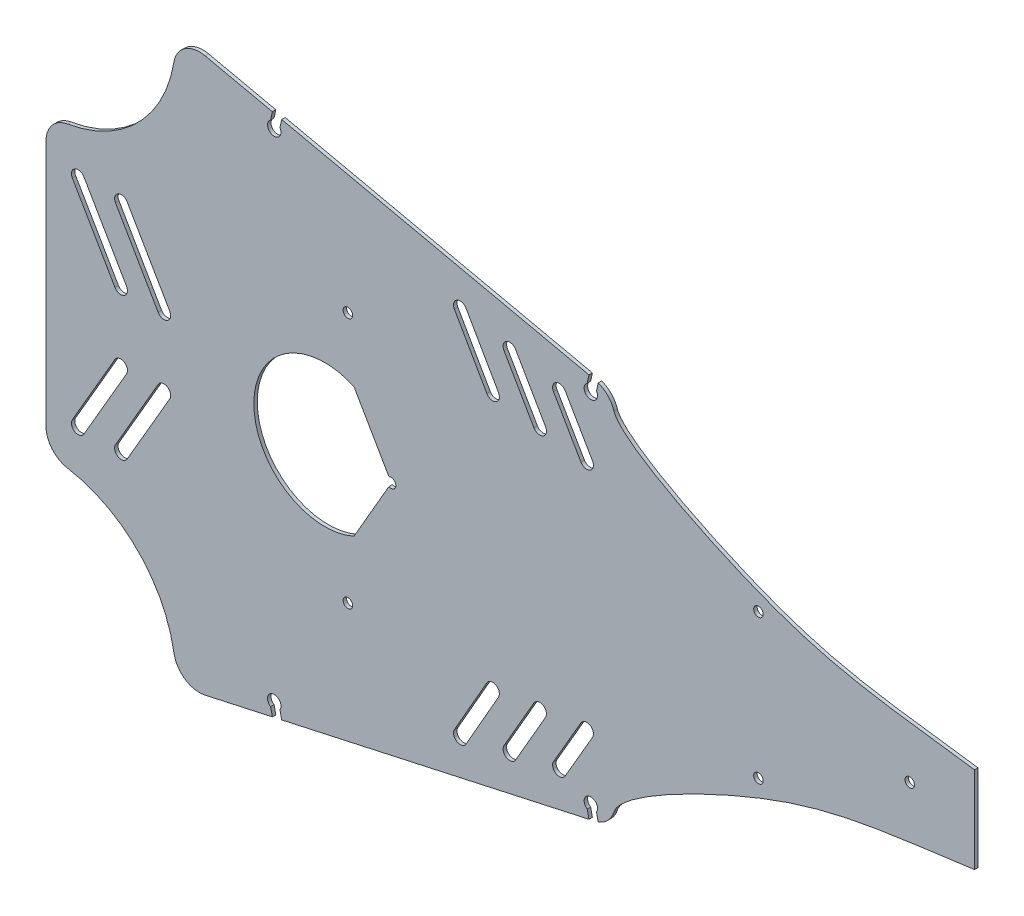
ISO-10303-21;
HEADER;
FILE_DESCRIPTION(('STEP AP214'),'2;1');
FILE_NAME('part.step','',(''),(''),'','','');
FILE_SCHEMA(('AUTOMOTIVE_DESIGN { 1 0 10303 214 1 1 1 1 }'));
ENDSEC;
DATA;
#1=APPLICATION_CONTEXT('core data for automotive mechanical design processes');
#2=APPLICATION_PROTOCOL_DEFINITION('international standard','automotive_design',2000,#1);
#3=PRODUCT_CONTEXT('',#1,'mechanical');
#4=PRODUCT('Part','Part','',(#3));
#5=PRODUCT_RELATED_PRODUCT_CATEGORY('part','',(#4));
#6=PRODUCT_DEFINITION_FORMATION('','',#4);
#7=PRODUCT_DEFINITION_CONTEXT('part definition',#1,'design');
#8=PRODUCT_DEFINITION('design','',#6,#7);
#9=PRODUCT_DEFINITION_SHAPE('','',#8);
#10=(LENGTH_UNIT() NAMED_UNIT(*) SI_UNIT(.MILLI.,.METRE.));
#11=(NAMED_UNIT(*) PLANE_ANGLE_UNIT() SI_UNIT($,.RADIAN.));
#12=(NAMED_UNIT(*) SI_UNIT($,.STERADIAN.) SOLID_ANGLE_UNIT());
#13=UNCERTAINTY_MEASURE_WITH_UNIT(LENGTH_MEASURE(1.E-05),#10,'distance_accuracy_value','');
#14=(GEOMETRIC_REPRESENTATION_CONTEXT(3) GLOBAL_UNCERTAINTY_ASSIGNED_CONTEXT((#13)) GLOBAL_UNIT_ASSIGNED_CONTEXT((#10,
#11,#12)) REPRESENTATION_CONTEXT('',''));
#15=CARTESIAN_POINT('',(0.,0.,0.));
#16=DIRECTION('',(0.,0.,1.));
#17=DIRECTION('',(1.,0.,0.));
#18=AXIS2_PLACEMENT_3D('',#15,#16,#17);
#19=CARTESIAN_POINT('',(61.9581352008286,64.0606319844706,0.8));
#20=DIRECTION('',(-0.214781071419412,-0.976662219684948,0.));
#21=DIRECTION('',(0.976662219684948,-0.214781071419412,0.));
#22=AXIS2_PLACEMENT_3D('',#19,#20,#21);
#23=PLANE('',#22);
#24=DIRECTION('',(-0.976662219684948,0.214781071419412,0.));
#25=VECTOR('',#24,1.);
#26=CARTESIAN_POINT('',(61.9581352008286,64.0606319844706,0.8));
#27=LINE('',#26,#25);
#28=CARTESIAN_POINT('',(77.5345899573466,60.6351614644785,0.8));
#29=VERTEX_POINT('',#28);
#30=CARTESIAN_POINT('',(61.9581352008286,64.0606319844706,0.8));
#31=VERTEX_POINT('',#30);
#32=EDGE_CURVE('E658',#29,#31,#27,.T.);
#33=ORIENTED_EDGE('',*,*,#32,.F.);
#34=DIRECTION('',(0.,0.,-1.));
#35=VECTOR('',#34,1.);
#36=CARTESIAN_POINT('',(77.5345899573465,60.6351614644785,0.8));
#37=LINE('',#36,#35);
#38=CARTESIAN_POINT('',(77.5345899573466,60.6351614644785,0.));
#39=VERTEX_POINT('',#38);
#40=EDGE_CURVE('E753',#29,#39,#37,.T.);
#41=ORIENTED_EDGE('',*,*,#40,.T.);
#42=DIRECTION('',(-0.976662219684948,0.214781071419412,0.));
#43=VECTOR('',#42,1.);
#44=CARTESIAN_POINT('',(61.9581352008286,64.0606319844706,0.));
#45=LINE('',#44,#43);
#46=CARTESIAN_POINT('',(61.9581352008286,64.0606319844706,0.));
#47=VERTEX_POINT('',#46);
#48=EDGE_CURVE('E545',#39,#47,#45,.T.);
#49=ORIENTED_EDGE('',*,*,#48,.T.);
#50=DIRECTION('',(0.,0.,-1.));
#51=VECTOR('',#50,1.);
#52=CARTESIAN_POINT('',(61.9581352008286,64.0606319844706,0.8));
#53=LINE('',#52,#51);
#54=EDGE_CURVE('E657',#31,#47,#53,.T.);
#55=ORIENTED_EDGE('',*,*,#54,.F.);
#56=EDGE_LOOP('',(#33,#41,#49,#55));
#57=FACE_BOUND('',#56,.T.);
#58=ADVANCED_FACE('F28',(#57),#23,.F.);
#59=CARTESIAN_POINT('',(61.9581352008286,-64.0606319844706,0.8));
#60=DIRECTION('',(-0.214781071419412,0.976662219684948,0.));
#61=DIRECTION('',(-0.976662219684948,-0.214781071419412,0.));
#62=AXIS2_PLACEMENT_3D('',#59,#60,#61);
#63=PLANE('',#62);
#64=DIRECTION('',(0.976662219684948,0.214781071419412,0.));
#65=VECTOR('',#64,1.);
#66=CARTESIAN_POINT('',(61.9581352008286,-64.0606319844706,0.));
#67=LINE('',#66,#65);
#68=CARTESIAN_POINT('',(61.9581352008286,-64.0606319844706,0.));
#69=VERTEX_POINT('',#68);
#70=CARTESIAN_POINT('',(77.5345899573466,-60.6351614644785,0.));
#71=VERTEX_POINT('',#70);
#72=EDGE_CURVE('E521',#69,#71,#67,.T.);
#73=ORIENTED_EDGE('',*,*,#72,.T.);
#74=DIRECTION('',(0.,0.,1.));
#75=VECTOR('',#74,1.);
#76=CARTESIAN_POINT('',(77.5345899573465,-60.6351614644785,0.8));
#77=LINE('',#76,#75);
#78=CARTESIAN_POINT('',(77.5345899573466,-60.6351614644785,0.8));
#79=VERTEX_POINT('',#78);
#80=EDGE_CURVE('E769',#71,#79,#77,.T.);
#81=ORIENTED_EDGE('',*,*,#80,.T.);
#82=DIRECTION('',(0.976662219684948,0.214781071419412,0.));
#83=VECTOR('',#82,1.);
#84=CARTESIAN_POINT('',(61.9581352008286,-64.0606319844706,0.8));
#85=LINE('',#84,#83);
#86=CARTESIAN_POINT('',(61.9581352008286,-64.0606319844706,0.8));
#87=VERTEX_POINT('',#86);
#88=EDGE_CURVE('E563',#87,#79,#85,.T.);
#89=ORIENTED_EDGE('',*,*,#88,.F.);
#90=DIRECTION('',(0.,0.,-1.));
#91=VECTOR('',#90,1.);
#92=CARTESIAN_POINT('',(61.9581352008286,-64.0606319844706,0.8));
#93=LINE('',#92,#91);
#94=EDGE_CURVE('E677',#87,#69,#93,.T.);
#95=ORIENTED_EDGE('',*,*,#94,.T.);
#96=EDGE_LOOP('',(#73,#81,#89,#95));
#97=FACE_BOUND('',#96,.T.);
#98=ADVANCED_FACE('F595',(#97),#63,.F.);
#99=CARTESIAN_POINT('',(60.6694487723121,58.200658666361,0.8));
#100=DIRECTION('',(0.,0.,1.));
#101=DIRECTION('',(1.,0.,0.));
#102=AXIS2_PLACEMENT_3D('',#99,#100,#101);
#103=PLANE('',#102);
#104=DIRECTION('',(-0.214781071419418,0.976662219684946,0.));
#105=VECTOR('',#104,1.);
#106=CARTESIAN_POINT('',(152.288570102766,-41.1240760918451,0.8));
#107=LINE('',#106,#105);
#108=CARTESIAN_POINT('',(152.920799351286,-43.9989775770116,0.8));
#109=VERTEX_POINT('',#108);
#110=CARTESIAN_POINT('',(152.523114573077,-42.1906073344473,0.8));
#111=VERTEX_POINT('',#110);
#112=EDGE_CURVE('E50',#109,#111,#107,.T.);
#113=ORIENTED_EDGE('',*,*,#112,.F.);
#114=CARTESIAN_POINT('',(150.842627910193,-38.3703717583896,0.8));
#115=DIRECTION('',(0.,0.,1.));
#116=DIRECTION('',(1.,0.,0.));
#117=AXIS2_PLACEMENT_3D('',#114,#115,#116);
#118=CIRCLE('',#117,6.00000000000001);
#119=CARTESIAN_POINT('',(156.555979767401,-40.2027501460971,0.8));
#120=VERTEX_POINT('',#119);
#121=EDGE_CURVE('E566',#109,#120,#118,.T.);
#122=ORIENTED_EDGE('',*,*,#121,.T.);
#123=CARTESIAN_POINT('',(156.555979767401,-40.2027501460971,0.8));
#124=CARTESIAN_POINT('',(158.014867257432,-35.6539421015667,0.8));
#125=CARTESIAN_POINT('',(198.784165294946,-14.481909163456,0.8));
#126=CARTESIAN_POINT('',(216.274031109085,-13.2295178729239,0.8));
#127=CARTESIAN_POINT('',(240.,-10.,0.8));
#128=B_SPLINE_CURVE_WITH_KNOTS('',3,(#123,#124,#125,#126,#127),.UNSPECIFIED.,.F.,.F.,(4,1,4),
(0.,0.347185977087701,0.920874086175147),.UNSPECIFIED.);
#129=CARTESIAN_POINT('',(240.,-10.,0.8));
#130=VERTEX_POINT('',#129);
#131=EDGE_CURVE('E568',#120,#130,#128,.T.);
#132=ORIENTED_EDGE('',*,*,#131,.T.);
#133=DIRECTION('',(0.,1.,0.));
#134=VECTOR('',#133,1.);
#135=CARTESIAN_POINT('',(240.,10.,0.8));
#136=LINE('',#135,#134);
#137=CARTESIAN_POINT('',(240.,10.,0.8));
#138=VERTEX_POINT('',#137);
#139=EDGE_CURVE('E573',#130,#138,#136,.T.);
#140=ORIENTED_EDGE('',*,*,#139,.T.);
#141=CARTESIAN_POINT('',(240.,10.,0.8));
#142=CARTESIAN_POINT('',(216.274031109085,13.2295178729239,0.8));
#143=CARTESIAN_POINT('',(198.784165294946,14.481909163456,0.8));
#144=CARTESIAN_POINT('',(158.014867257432,35.6539421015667,0.8));
#145=CARTESIAN_POINT('',(156.555979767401,40.2027501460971,0.8));
#146=B_SPLINE_CURVE_WITH_KNOTS('',3,(#141,#142,#143,#144,#145),.UNSPECIFIED.,.F.,.F.,(4,1,4),
(0.,0.573688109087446,0.920874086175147),.UNSPECIFIED.);
#147=CARTESIAN_POINT('',(156.555979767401,40.2027501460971,0.8));
#148=VERTEX_POINT('',#147);
#149=EDGE_CURVE('E1727',#138,#148,#146,.T.);
#150=ORIENTED_EDGE('',*,*,#149,.T.);
#151=CARTESIAN_POINT('',(150.842627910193,38.3703717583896,0.8));
#152=DIRECTION('',(0.,0.,1.));
#153=DIRECTION('',(-1.,0.,0.));
#154=AXIS2_PLACEMENT_3D('',#151,#152,#153);
#155=CIRCLE('',#154,6.00000000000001);
#156=CARTESIAN_POINT('',(152.920799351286,43.9989775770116,0.8));
#157=VERTEX_POINT('',#156);
#158=EDGE_CURVE('E663',#148,#157,#155,.T.);
#159=ORIENTED_EDGE('',*,*,#158,.T.);
#160=DIRECTION('',(0.214781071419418,0.976662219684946,0.));
#161=VECTOR('',#160,1.);
#162=CARTESIAN_POINT('',(152.288570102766,41.1240760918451,0.8));
#163=LINE('',#162,#161);
#164=CARTESIAN_POINT('',(152.523114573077,42.1906073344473,0.8));
#165=VERTEX_POINT('',#164);
#166=EDGE_CURVE('E716',#165,#157,#163,.T.);
#167=ORIENTED_EDGE('',*,*,#166,.F.);
#168=CARTESIAN_POINT('',(151.214241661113,41.3603352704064,0.8));
#169=DIRECTION('',(0.,0.,1.));
#170=DIRECTION('',(1.,0.,0.));
#171=AXIS2_PLACEMENT_3D('',#168,#169,#170);
#172=CIRCLE('',#171,1.54999999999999);
#173=CARTESIAN_POINT('',(150.37445768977,42.66312569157,0.8));
#174=VERTEX_POINT('',#173);
#175=EDGE_CURVE('E497',#174,#165,#172,.T.);
#176=ORIENTED_EDGE('',*,*,#175,.F.);
#177=DIRECTION('',(-0.214781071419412,-0.976662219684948,0.));
#178=VECTOR('',#177,1.);
#179=CARTESIAN_POINT('',(150.139913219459,41.5965944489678,0.8));
#180=LINE('',#179,#178);
#181=CARTESIAN_POINT('',(150.784256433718,44.5265811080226,0.8));
#182=VERTEX_POINT('',#181);
#183=EDGE_CURVE('E724',#182,#174,#180,.T.);
#184=ORIENTED_EDGE('',*,*,#183,.F.);
#185=CARTESIAN_POINT('',(79.6832468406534,60.1626431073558,0.8));
#186=VERTEX_POINT('',#185);
#187=EDGE_CURVE('E649',#182,#186,#27,.T.);
#188=ORIENTED_EDGE('',*,*,#187,.T.);
#189=DIRECTION('',(0.214781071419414,0.976662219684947,0.));
#190=VECTOR('',#189,1.);
#191=CARTESIAN_POINT('',(79.0389036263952,57.2326564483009,0.8));
#192=LINE('',#191,#190);
#193=CARTESIAN_POINT('',(79.2734480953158,58.2991876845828,0.8));
#194=VERTEX_POINT('',#193);
#195=EDGE_CURVE('E743',#194,#186,#192,.T.);
#196=ORIENTED_EDGE('',*,*,#195,.F.);
#197=CARTESIAN_POINT('',(77.9645751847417,57.4689156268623,0.8));
#198=DIRECTION('',(0.,0.,1.));
#199=DIRECTION('',(1.,0.,0.));
#200=AXIS2_PLACEMENT_3D('',#197,#198,#199);
#201=CIRCLE('',#200,1.54999999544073);
#202=CARTESIAN_POINT('',(77.124791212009,58.7717060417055,0.8));
#203=VERTEX_POINT('',#202);
#204=EDGE_CURVE('E1116',#203,#194,#201,.T.);
#205=ORIENTED_EDGE('',*,*,#204,.F.);
#206=DIRECTION('',(-0.214781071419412,-0.976662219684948,0.));
#207=VECTOR('',#206,1.);
#208=CARTESIAN_POINT('',(76.8902467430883,57.7051748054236,0.8));
#209=LINE('',#208,#207);
#210=EDGE_CURVE('E745',#29,#203,#209,.T.);
#211=ORIENTED_EDGE('',*,*,#210,.F.);
#212=ORIENTED_EDGE('',*,*,#32,.T.);
#213=CARTESIAN_POINT('',(60.6694487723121,58.200658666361,0.8));
#214=DIRECTION('',(0.,0.,1.));
#215=DIRECTION('',(1.,0.,0.));
#216=AXIS2_PLACEMENT_3D('',#213,#214,#215);
#217=CIRCLE('',#216,6.);
#218=CARTESIAN_POINT('',(54.7496279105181,59.1782684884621,0.8));
#219=VERTEX_POINT('',#218);
#220=EDGE_CURVE('E548',#31,#219,#217,.T.);
#221=ORIENTED_EDGE('',*,*,#220,.T.);
#222=CARTESIAN_POINT('',(25.1505236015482,64.0663175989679,0.8));
#223=DIRECTION('',(0.,0.,-1.));
#224=DIRECTION('',(1.,0.,0.));
#225=AXIS2_PLACEMENT_3D('',#222,#223,#224);
#226=CIRCLE('',#225,30.);
#227=CARTESIAN_POINT('',(30.1505236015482,34.4859186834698,0.8));
#228=VERTEX_POINT('',#227);
#229=EDGE_CURVE('E551',#219,#228,#226,.T.);
#230=ORIENTED_EDGE('',*,*,#229,.T.);
#231=CARTESIAN_POINT('',(31.1505236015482,28.5698389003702,0.8));
#232=DIRECTION('',(0.,0.,1.));
#233=DIRECTION('',(1.,0.,0.));
#234=AXIS2_PLACEMENT_3D('',#231,#232,#233);
#235=CIRCLE('',#234,6.);
#236=CARTESIAN_POINT('',(25.1505236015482,28.5698389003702,0.8));
#237=VERTEX_POINT('',#236);
#238=EDGE_CURVE('E553',#228,#237,#235,.T.);
#239=ORIENTED_EDGE('',*,*,#238,.T.);
#240=DIRECTION('',(0.,-1.,0.));
#241=VECTOR('',#240,1.);
#242=CARTESIAN_POINT('',(25.1505236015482,28.5698389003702,0.8));
#243=LINE('',#242,#241);
#244=CARTESIAN_POINT('',(25.1505236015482,-28.5698389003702,0.8));
#245=VERTEX_POINT('',#244);
#246=EDGE_CURVE('E555',#237,#245,#243,.T.);
#247=ORIENTED_EDGE('',*,*,#246,.T.);
#248=CARTESIAN_POINT('',(31.1505236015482,-28.5698389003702,0.8));
#249=DIRECTION('',(0.,0.,1.));
#250=DIRECTION('',(-1.,0.,0.));
#251=AXIS2_PLACEMENT_3D('',#248,#249,#250);
#252=CIRCLE('',#251,6.);
#253=CARTESIAN_POINT('',(30.1505236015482,-34.4859186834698,0.8));
#254=VERTEX_POINT('',#253);
#255=EDGE_CURVE('E557',#245,#254,#252,.T.);
#256=ORIENTED_EDGE('',*,*,#255,.T.);
#257=CARTESIAN_POINT('',(25.1505236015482,-64.0663175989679,0.8));
#258=DIRECTION('',(0.,0.,-1.));
#259=DIRECTION('',(-1.,0.,0.));
#260=AXIS2_PLACEMENT_3D('',#257,#258,#259);
#261=CIRCLE('',#260,30.);
#262=CARTESIAN_POINT('',(54.7496279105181,-59.1782684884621,0.8));
#263=VERTEX_POINT('',#262);
#264=EDGE_CURVE('E559',#254,#263,#261,.T.);
#265=ORIENTED_EDGE('',*,*,#264,.T.);
#266=CARTESIAN_POINT('',(60.6694487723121,-58.200658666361,0.8));
#267=DIRECTION('',(0.,0.,1.));
#268=DIRECTION('',(-1.,0.,0.));
#269=AXIS2_PLACEMENT_3D('',#266,#267,#268);
#270=CIRCLE('',#269,6.);
#271=EDGE_CURVE('E561',#263,#87,#270,.T.);
#272=ORIENTED_EDGE('',*,*,#271,.T.);
#273=ORIENTED_EDGE('',*,*,#88,.T.);
#274=DIRECTION('',(0.214781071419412,-0.976662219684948,0.));
#275=VECTOR('',#274,1.);
#276=CARTESIAN_POINT('',(76.8902467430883,-57.7051748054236,0.8));
#277=LINE('',#276,#275);
#278=CARTESIAN_POINT('',(77.124791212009,-58.7717060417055,0.8));
#279=VERTEX_POINT('',#278);
#280=EDGE_CURVE('E756',#279,#79,#277,.T.);
#281=ORIENTED_EDGE('',*,*,#280,.F.);
#282=CARTESIAN_POINT('',(77.9645751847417,-57.4689156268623,0.8));
#283=DIRECTION('',(0.,0.,1.));
#284=DIRECTION('',(-1.,0.,0.));
#285=AXIS2_PLACEMENT_3D('',#282,#283,#284);
#286=CIRCLE('',#285,1.54999999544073);
#287=CARTESIAN_POINT('',(79.2734480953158,-58.2991876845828,0.8));
#288=VERTEX_POINT('',#287);
#289=EDGE_CURVE('E1122',#288,#279,#286,.T.);
#290=ORIENTED_EDGE('',*,*,#289,.F.);
#291=DIRECTION('',(-0.214781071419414,0.976662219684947,0.));
#292=VECTOR('',#291,1.);
#293=CARTESIAN_POINT('',(79.0389036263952,-57.2326564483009,0.8));
#294=LINE('',#293,#292);
#295=CARTESIAN_POINT('',(79.6832468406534,-60.1626431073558,0.8));
#296=VERTEX_POINT('',#295);
#297=EDGE_CURVE('E758',#296,#288,#294,.T.);
#298=ORIENTED_EDGE('',*,*,#297,.F.);
#299=CARTESIAN_POINT('',(150.784256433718,-44.5265811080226,0.8));
#300=VERTEX_POINT('',#299);
#301=EDGE_CURVE('E490',#296,#300,#85,.T.);
#302=ORIENTED_EDGE('',*,*,#301,.T.);
#303=DIRECTION('',(0.214781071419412,-0.976662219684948,0.));
#304=VECTOR('',#303,1.);
#305=CARTESIAN_POINT('',(150.139913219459,-41.5965944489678,0.8));
#306=LINE('',#305,#304);
#307=CARTESIAN_POINT('',(150.37445768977,-42.66312569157,0.8));
#308=VERTEX_POINT('',#307);
#309=EDGE_CURVE('E475',#308,#300,#306,.T.);
#310=ORIENTED_EDGE('',*,*,#309,.F.);
#311=CARTESIAN_POINT('',(151.214241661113,-41.3603352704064,0.8));
#312=DIRECTION('',(0.,0.,1.));
#313=DIRECTION('',(-1.,0.,0.));
#314=AXIS2_PLACEMENT_3D('',#311,#312,#313);
#315=CIRCLE('',#314,1.54999999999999);
#316=EDGE_CURVE('E487',#111,#308,#315,.T.);
#317=ORIENTED_EDGE('',*,*,#316,.F.);
#318=EDGE_LOOP('',(#113,#122,#132,#140,#150,#159,#167,#176,#184,#188,#196,#205,#211,#212,#221,
#230,#239,#247,#256,#265,#272,#273,#281,#290,#298,#302,#310,#317));
#319=FACE_BOUND('',#318,.T.);
#320=CARTESIAN_POINT('',(52.4430897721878,8.,0.8));
#321=DIRECTION('',(0.,0.,1.));
#322=DIRECTION('',(1.,0.,0.));
#323=AXIS2_PLACEMENT_3D('',#320,#321,#322);
#324=CIRCLE('',#323,1.55);
#325=CARTESIAN_POINT('',(51.1024723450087,7.22202511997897,0.8));
#326=VERTEX_POINT('',#325);
#327=CARTESIAN_POINT('',(53.7837071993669,8.77797488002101,0.8));
#328=VERTEX_POINT('',#327);
#329=EDGE_CURVE('E772',#326,#328,#324,.T.);
#330=ORIENTED_EDGE('',*,*,#329,.F.);
#331=DIRECTION('',(0.501919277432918,-0.864914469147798,0.));
#332=VECTOR('',#331,1.);
#333=CARTESIAN_POINT('',(41.2371873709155,24.222025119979,0.8));
#334=LINE('',#333,#332);
#335=CARTESIAN_POINT('',(41.2371873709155,24.222025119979,0.8));
#336=VERTEX_POINT('',#335);
#337=EDGE_CURVE('E780',#336,#326,#334,.T.);
#338=ORIENTED_EDGE('',*,*,#337,.F.);
#339=CARTESIAN_POINT('',(42.5778047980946,25.,0.8));
#340=DIRECTION('',(0.,0.,1.));
#341=DIRECTION('',(1.,0.,0.));
#342=AXIS2_PLACEMENT_3D('',#339,#340,#341);
#343=CIRCLE('',#342,1.55);
#344=CARTESIAN_POINT('',(43.9184222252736,25.777974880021,0.8));
#345=VERTEX_POINT('',#344);
#346=EDGE_CURVE('E777',#345,#336,#343,.T.);
#347=ORIENTED_EDGE('',*,*,#346,.F.);
#348=DIRECTION('',(-0.501919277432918,0.864914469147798,0.));
#349=VECTOR('',#348,1.);
#350=CARTESIAN_POINT('',(43.9184222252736,25.777974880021,0.8));
#351=LINE('',#350,#349);
#352=EDGE_CURVE('E774',#328,#345,#351,.T.);
#353=ORIENTED_EDGE('',*,*,#352,.F.);
#354=EDGE_LOOP('',(#330,#338,#347,#353));
#355=FACE_BOUND('',#354,.T.);
#356=CARTESIAN_POINT('',(32.5778047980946,25.,0.8));
#357=DIRECTION('',(0.,0.,1.));
#358=DIRECTION('',(1.,0.,0.));
#359=AXIS2_PLACEMENT_3D('',#356,#357,#358);
#360=CIRCLE('',#359,1.55);
#361=CARTESIAN_POINT('',(33.9184222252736,25.777974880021,0.8));
#362=VERTEX_POINT('',#361);
#363=CARTESIAN_POINT('',(31.2371873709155,24.222025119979,0.8));
#364=VERTEX_POINT('',#363);
#365=EDGE_CURVE('E798',#362,#364,#360,.T.);
#366=ORIENTED_EDGE('',*,*,#365,.F.);
#367=DIRECTION('',(-0.501919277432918,0.864914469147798,0.));
#368=VECTOR('',#367,1.);
#369=CARTESIAN_POINT('',(33.9184222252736,25.777974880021,0.8));
#370=LINE('',#369,#368);
#371=CARTESIAN_POINT('',(43.7837071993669,8.77797488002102,0.8));
#372=VERTEX_POINT('',#371);
#373=EDGE_CURVE('E812',#372,#362,#370,.T.);
#374=ORIENTED_EDGE('',*,*,#373,.F.);
#375=CARTESIAN_POINT('',(42.4430897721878,8.,0.8));
#376=DIRECTION('',(0.,0.,1.));
#377=DIRECTION('',(1.,0.,0.));
#378=AXIS2_PLACEMENT_3D('',#375,#376,#377);
#379=CIRCLE('',#378,1.55);
#380=CARTESIAN_POINT('',(41.1024723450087,7.22202511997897,0.8));
#381=VERTEX_POINT('',#380);
#382=EDGE_CURVE('E809',#381,#372,#379,.T.);
#383=ORIENTED_EDGE('',*,*,#382,.F.);
#384=DIRECTION('',(0.501919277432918,-0.864914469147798,0.));
#385=VECTOR('',#384,1.);
#386=CARTESIAN_POINT('',(31.2371873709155,24.222025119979,0.8));
#387=LINE('',#386,#385);
#388=EDGE_CURVE('E806',#364,#381,#387,.T.);
#389=ORIENTED_EDGE('',*,*,#388,.F.);
#390=EDGE_LOOP('',(#366,#374,#383,#389));
#391=FACE_BOUND('',#390,.T.);
#392=CARTESIAN_POINT('',(143.921730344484,37.844578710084,0.8));
#393=DIRECTION('',(0.,0.,1.));
#394=DIRECTION('',(-1.,0.,0.));
#395=AXIS2_PLACEMENT_3D('',#392,#393,#394);
#396=CIRCLE('',#395,1.55);
#397=CARTESIAN_POINT('',(145.262347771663,38.6225535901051,0.8));
#398=VERTEX_POINT('',#397);
#399=CARTESIAN_POINT('',(142.581112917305,37.066603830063,0.8));
#400=VERTEX_POINT('',#399);
#401=EDGE_CURVE('E830',#398,#400,#396,.T.);
#402=ORIENTED_EDGE('',*,*,#401,.F.);
#403=DIRECTION('',(-0.501919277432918,0.864914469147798,0.));
#404=VECTOR('',#403,1.);
#405=CARTESIAN_POINT('',(151.607860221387,27.6878758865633,0.8));
#406=LINE('',#405,#404);
#407=CARTESIAN_POINT('',(151.607860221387,27.6878758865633,0.8));
#408=VERTEX_POINT('',#407);
#409=EDGE_CURVE('E844',#408,#398,#406,.T.);
#410=ORIENTED_EDGE('',*,*,#409,.F.);
#411=CARTESIAN_POINT('',(150.267242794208,26.9099010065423,0.8));
#412=DIRECTION('',(0.,0.,1.));
#413=DIRECTION('',(1.,0.,0.));
#414=AXIS2_PLACEMENT_3D('',#411,#412,#413);
#415=CIRCLE('',#414,1.55);
#416=CARTESIAN_POINT('',(148.926625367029,26.1319261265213,0.8));
#417=VERTEX_POINT('',#416);
#418=EDGE_CURVE('E841',#417,#408,#415,.T.);
#419=ORIENTED_EDGE('',*,*,#418,.F.);
#420=DIRECTION('',(0.501919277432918,-0.864914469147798,0.));
#421=VECTOR('',#420,1.);
#422=CARTESIAN_POINT('',(148.926625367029,26.1319261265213,0.8));
#423=LINE('',#422,#421);
#424=EDGE_CURVE('E838',#400,#417,#423,.T.);
#425=ORIENTED_EDGE('',*,*,#424,.F.);
#426=EDGE_LOOP('',(#402,#410,#419,#425));
#427=FACE_BOUND('',#426,.T.);
#428=CARTESIAN_POINT('',(132.458860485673,40.3654169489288,0.8));
#429=DIRECTION('',(0.,0.,1.));
#430=DIRECTION('',(-1.,0.,0.));
#431=AXIS2_PLACEMENT_3D('',#428,#429,#430);
#432=CIRCLE('',#431,1.55);
#433=CARTESIAN_POINT('',(133.801768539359,41.139431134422,0.8));
#434=VERTEX_POINT('',#433);
#435=CARTESIAN_POINT('',(131.115952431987,39.5914027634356,0.8));
#436=VERTEX_POINT('',#435);
#437=EDGE_CURVE('E862',#434,#436,#432,.T.);
#438=ORIENTED_EDGE('',*,*,#437,.F.);
#439=DIRECTION('',(-0.499363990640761,0.866392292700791,0.));
#440=VECTOR('',#439,1.);
#441=CARTESIAN_POINT('',(140.739609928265,29.1023351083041,0.8));
#442=LINE('',#441,#440);
#443=CARTESIAN_POINT('',(140.739609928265,29.1023351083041,0.8));
#444=VERTEX_POINT('',#443);
#445=EDGE_CURVE('E876',#444,#434,#442,.T.);
#446=ORIENTED_EDGE('',*,*,#445,.F.);
#447=CARTESIAN_POINT('',(139.396701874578,28.328320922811,0.8));
#448=DIRECTION('',(0.,0.,1.));
#449=DIRECTION('',(-1.,0.,0.));
#450=AXIS2_PLACEMENT_3D('',#447,#448,#449);
#451=CIRCLE('',#450,1.55);
#452=CARTESIAN_POINT('',(138.053793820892,27.5543067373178,0.8));
#453=VERTEX_POINT('',#452);
#454=EDGE_CURVE('E873',#453,#444,#451,.T.);
#455=ORIENTED_EDGE('',*,*,#454,.F.);
#456=DIRECTION('',(0.499363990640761,-0.866392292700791,0.));
#457=VECTOR('',#456,1.);
#458=CARTESIAN_POINT('',(138.053793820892,27.5543067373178,0.8));
#459=LINE('',#458,#457);
#460=EDGE_CURVE('E870',#436,#453,#459,.T.);
#461=ORIENTED_EDGE('',*,*,#460,.F.);
#462=EDGE_LOOP('',(#438,#446,#455,#461));
#463=FACE_BOUND('',#462,.T.);
#464=CARTESIAN_POINT('',(120.995990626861,42.8862551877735,0.8));
#465=DIRECTION('',(0.,0.,1.));
#466=DIRECTION('',(-1.,0.,0.));
#467=AXIS2_PLACEMENT_3D('',#464,#465,#466);
#468=CIRCLE('',#467,1.55000000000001);
#469=CARTESIAN_POINT('',(122.34165839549,43.6554614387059,0.8));
#470=VERTEX_POINT('',#469);
#471=CARTESIAN_POINT('',(119.650322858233,42.1170489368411,0.8));
#472=VERTEX_POINT('',#471);
#473=EDGE_CURVE('E894',#470,#472,#468,.T.);
#474=ORIENTED_EDGE('',*,*,#473,.F.);
#475=DIRECTION('',(-0.496262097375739,0.868172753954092,0.));
#476=VECTOR('',#475,1.);
#477=CARTESIAN_POINT('',(129.85086113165,30.5186830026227,0.8));
#478=LINE('',#477,#476);
#479=CARTESIAN_POINT('',(129.85086113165,30.5186830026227,0.8));
#480=VERTEX_POINT('',#479);
#481=EDGE_CURVE('E908',#480,#470,#478,.T.);
#482=ORIENTED_EDGE('',*,*,#481,.F.);
#483=CARTESIAN_POINT('',(128.505193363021,29.7494767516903,0.8));
#484=DIRECTION('',(0.,0.,1.));
#485=DIRECTION('',(-1.,0.,0.));
#486=AXIS2_PLACEMENT_3D('',#483,#484,#485);
#487=CIRCLE('',#486,1.55000000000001);
#488=CARTESIAN_POINT('',(127.159525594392,28.9802705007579,0.8));
#489=VERTEX_POINT('',#488);
#490=EDGE_CURVE('E905',#489,#480,#487,.T.);
#491=ORIENTED_EDGE('',*,*,#490,.F.);
#492=DIRECTION('',(0.496262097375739,-0.868172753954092,0.));
#493=VECTOR('',#492,1.);
#494=CARTESIAN_POINT('',(127.159525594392,28.9802705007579,0.8));
#495=LINE('',#494,#493);
#496=EDGE_CURVE('E902',#472,#489,#495,.T.);
#497=ORIENTED_EDGE('',*,*,#496,.F.);
#498=EDGE_LOOP('',(#474,#482,#491,#497));
#499=FACE_BOUND('',#498,.T.);
#500=DIRECTION('',(0.500000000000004,0.866025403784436,0.));
#501=VECTOR('',#500,1.);
#502=CARTESIAN_POINT('',(105.067234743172,0.,0.8));
#503=LINE('',#502,#501);
#504=CARTESIAN_POINT('',(96.406980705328,-15.,0.8));
#505=VERTEX_POINT('',#504);
#506=CARTESIAN_POINT('',(104.50119713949,-0.980405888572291,0.8));
#507=VERTEX_POINT('',#506);
#508=EDGE_CURVE('E926',#505,#507,#503,.T.);
#509=ORIENTED_EDGE('',*,*,#508,.F.);
#510=CARTESIAN_POINT('',(89.6766147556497,0.,0.8));
#511=DIRECTION('',(0.,0.,1.));
#512=DIRECTION('',(1.,0.,0.));
#513=AXIS2_PLACEMENT_3D('',#510,#511,#512);
#514=CIRCLE('',#513,16.4407367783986);
#515=CARTESIAN_POINT('',(96.406980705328,15.,0.8));
#516=VERTEX_POINT('',#515);
#517=EDGE_CURVE('E936',#516,#505,#514,.T.);
#518=ORIENTED_EDGE('',*,*,#517,.F.);
#519=DIRECTION('',(-0.500000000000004,0.866025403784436,0.));
#520=VECTOR('',#519,1.);
#521=CARTESIAN_POINT('',(105.067234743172,0.,0.8));
#522=LINE('',#521,#520);
#523=CARTESIAN_POINT('',(104.50119713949,0.980405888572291,0.8));
#524=VERTEX_POINT('',#523);
#525=EDGE_CURVE('E934',#524,#516,#522,.T.);
#526=ORIENTED_EDGE('',*,*,#525,.F.);
#527=CARTESIAN_POINT('',(105.,0.,0.8));
#528=DIRECTION('',(0.,0.,1.));
#529=DIRECTION('',(1.,0.,0.));
#530=AXIS2_PLACEMENT_3D('',#527,#528,#529);
#531=CIRCLE('',#530,1.10000000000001);
#532=EDGE_CURVE('E1146',#507,#524,#531,.T.);
#533=ORIENTED_EDGE('',*,*,#532,.F.);
#534=EDGE_LOOP('',(#509,#518,#526,#533));
#535=FACE_BOUND('',#534,.T.);
#536=CARTESIAN_POINT('',(42.5778047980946,-25.,0.8));
#537=DIRECTION('',(0.,0.,1.));
#538=DIRECTION('',(-1.,0.,0.));
#539=AXIS2_PLACEMENT_3D('',#536,#537,#538);
#540=CIRCLE('',#539,1.55);
#541=CARTESIAN_POINT('',(41.2371873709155,-24.222025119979,0.8));
#542=VERTEX_POINT('',#541);
#543=CARTESIAN_POINT('',(43.9184222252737,-25.777974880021,0.8));
#544=VERTEX_POINT('',#543);
#545=EDGE_CURVE('E951',#542,#544,#540,.T.);
#546=ORIENTED_EDGE('',*,*,#545,.F.);
#547=DIRECTION('',(-0.501919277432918,-0.864914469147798,0.));
#548=VECTOR('',#547,1.);
#549=CARTESIAN_POINT('',(41.2371873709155,-24.222025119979,0.8));
#550=LINE('',#549,#548);
#551=CARTESIAN_POINT('',(51.1024723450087,-7.22202511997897,0.8));
#552=VERTEX_POINT('',#551);
#553=EDGE_CURVE('E961',#552,#542,#550,.T.);
#554=ORIENTED_EDGE('',*,*,#553,.F.);
#555=CARTESIAN_POINT('',(52.4430897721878,-8.,0.8));
#556=DIRECTION('',(0.,0.,1.));
#557=DIRECTION('',(-1.,0.,0.));
#558=AXIS2_PLACEMENT_3D('',#555,#556,#557);
#559=CIRCLE('',#558,1.55);
#560=CARTESIAN_POINT('',(53.7837071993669,-8.77797488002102,0.8));
#561=VERTEX_POINT('',#560);
#562=EDGE_CURVE('E958',#561,#552,#559,.T.);
#563=ORIENTED_EDGE('',*,*,#562,.F.);
#564=DIRECTION('',(0.501919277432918,0.864914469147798,0.));
#565=VECTOR('',#564,1.);
#566=CARTESIAN_POINT('',(43.9184222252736,-25.777974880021,0.8));
#567=LINE('',#566,#565);
#568=EDGE_CURVE('E955',#544,#561,#567,.T.);
#569=ORIENTED_EDGE('',*,*,#568,.F.);
#570=EDGE_LOOP('',(#546,#554,#563,#569));
#571=FACE_BOUND('',#570,.T.);
#572=CARTESIAN_POINT('',(32.5778047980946,-25.,0.8));
#573=DIRECTION('',(0.,0.,1.));
#574=DIRECTION('',(-1.,0.,0.));
#575=AXIS2_PLACEMENT_3D('',#572,#573,#574);
#576=CIRCLE('',#575,1.55);
#577=CARTESIAN_POINT('',(31.2371873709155,-24.222025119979,0.8));
#578=VERTEX_POINT('',#577);
#579=CARTESIAN_POINT('',(33.9184222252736,-25.777974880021,0.8));
#580=VERTEX_POINT('',#579);
#581=EDGE_CURVE('E979',#578,#580,#576,.T.);
#582=ORIENTED_EDGE('',*,*,#581,.F.);
#583=DIRECTION('',(-0.501919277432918,-0.864914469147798,0.));
#584=VECTOR('',#583,1.);
#585=CARTESIAN_POINT('',(31.2371873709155,-24.222025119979,0.8));
#586=LINE('',#585,#584);
#587=CARTESIAN_POINT('',(41.1024723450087,-7.22202511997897,0.8));
#588=VERTEX_POINT('',#587);
#589=EDGE_CURVE('E993',#588,#578,#586,.T.);
#590=ORIENTED_EDGE('',*,*,#589,.F.);
#591=CARTESIAN_POINT('',(42.4430897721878,-8.,0.8));
#592=DIRECTION('',(0.,0.,1.));
#593=DIRECTION('',(-1.,0.,0.));
#594=AXIS2_PLACEMENT_3D('',#591,#592,#593);
#595=CIRCLE('',#594,1.55);
#596=CARTESIAN_POINT('',(43.7837071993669,-8.77797488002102,0.8));
#597=VERTEX_POINT('',#596);
#598=EDGE_CURVE('E990',#597,#588,#595,.T.);
#599=ORIENTED_EDGE('',*,*,#598,.F.);
#600=DIRECTION('',(0.501919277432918,0.864914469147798,0.));
#601=VECTOR('',#600,1.);
#602=CARTESIAN_POINT('',(33.9184222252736,-25.777974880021,0.8));
#603=LINE('',#602,#601);
#604=EDGE_CURVE('E987',#580,#597,#603,.T.);
#605=ORIENTED_EDGE('',*,*,#604,.F.);
#606=EDGE_LOOP('',(#582,#590,#599,#605));
#607=FACE_BOUND('',#606,.T.);
#608=CARTESIAN_POINT('',(128.505193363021,-29.7494767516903,0.8));
#609=DIRECTION('',(0.,0.,1.));
#610=DIRECTION('',(1.,0.,0.));
#611=AXIS2_PLACEMENT_3D('',#608,#609,#610);
#612=CIRCLE('',#611,1.55000000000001);
#613=CARTESIAN_POINT('',(129.85086113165,-30.5186830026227,0.8));
#614=VERTEX_POINT('',#613);
#615=CARTESIAN_POINT('',(127.159525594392,-28.9802705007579,0.8));
#616=VERTEX_POINT('',#615);
#617=EDGE_CURVE('E1011',#614,#616,#612,.T.);
#618=ORIENTED_EDGE('',*,*,#617,.F.);
#619=DIRECTION('',(0.496262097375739,0.868172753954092,0.));
#620=VECTOR('',#619,1.);
#621=CARTESIAN_POINT('',(129.85086113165,-30.5186830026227,0.8));
#622=LINE('',#621,#620);
#623=CARTESIAN_POINT('',(122.34165839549,-43.6554614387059,0.8));
#624=VERTEX_POINT('',#623);
#625=EDGE_CURVE('E1025',#624,#614,#622,.T.);
#626=ORIENTED_EDGE('',*,*,#625,.F.);
#627=CARTESIAN_POINT('',(120.995990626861,-42.8862551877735,0.8));
#628=DIRECTION('',(0.,0.,1.));
#629=DIRECTION('',(1.,0.,0.));
#630=AXIS2_PLACEMENT_3D('',#627,#628,#629);
#631=CIRCLE('',#630,1.55000000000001);
#632=CARTESIAN_POINT('',(119.650322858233,-42.1170489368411,0.8));
#633=VERTEX_POINT('',#632);
#634=EDGE_CURVE('E1022',#633,#624,#631,.T.);
#635=ORIENTED_EDGE('',*,*,#634,.F.);
#636=DIRECTION('',(-0.496262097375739,-0.868172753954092,0.));
#637=VECTOR('',#636,1.);
#638=CARTESIAN_POINT('',(127.159525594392,-28.9802705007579,0.8));
#639=LINE('',#638,#637);
#640=EDGE_CURVE('E1019',#616,#633,#639,.T.);
#641=ORIENTED_EDGE('',*,*,#640,.F.);
#642=EDGE_LOOP('',(#618,#626,#635,#641));
#643=FACE_BOUND('',#642,.T.);
#644=CARTESIAN_POINT('',(150.267242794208,-26.9099010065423,0.8));
#645=DIRECTION('',(0.,0.,1.));
#646=DIRECTION('',(-1.,0.,0.));
#647=AXIS2_PLACEMENT_3D('',#644,#645,#646);
#648=CIRCLE('',#647,1.55);
#649=CARTESIAN_POINT('',(151.607860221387,-27.6878758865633,0.8));
#650=VERTEX_POINT('',#649);
#651=CARTESIAN_POINT('',(148.926625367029,-26.1319261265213,0.8));
#652=VERTEX_POINT('',#651);
#653=EDGE_CURVE('E1043',#650,#652,#648,.T.);
#654=ORIENTED_EDGE('',*,*,#653,.F.);
#655=DIRECTION('',(0.501919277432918,0.864914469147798,0.));
#656=VECTOR('',#655,1.);
#657=CARTESIAN_POINT('',(151.607860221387,-27.6878758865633,0.8));
#658=LINE('',#657,#656);
#659=CARTESIAN_POINT('',(145.262347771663,-38.6225535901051,0.8));
#660=VERTEX_POINT('',#659);
#661=EDGE_CURVE('E1057',#660,#650,#658,.T.);
#662=ORIENTED_EDGE('',*,*,#661,.F.);
#663=CARTESIAN_POINT('',(143.921730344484,-37.844578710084,0.8));
#664=DIRECTION('',(0.,0.,1.));
#665=DIRECTION('',(1.,0.,0.));
#666=AXIS2_PLACEMENT_3D('',#663,#664,#665);
#667=CIRCLE('',#666,1.55);
#668=CARTESIAN_POINT('',(142.581112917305,-37.066603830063,0.8));
#669=VERTEX_POINT('',#668);
#670=EDGE_CURVE('E1054',#669,#660,#667,.T.);
#671=ORIENTED_EDGE('',*,*,#670,.F.);
#672=DIRECTION('',(-0.501919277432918,-0.864914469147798,0.));
#673=VECTOR('',#672,1.);
#674=CARTESIAN_POINT('',(148.926625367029,-26.1319261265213,0.8));
#675=LINE('',#674,#673);
#676=EDGE_CURVE('E1051',#652,#669,#675,.T.);
#677=ORIENTED_EDGE('',*,*,#676,.F.);
#678=EDGE_LOOP('',(#654,#662,#671,#677));
#679=FACE_BOUND('',#678,.T.);
#680=CARTESIAN_POINT('',(139.396701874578,-28.328320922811,0.8));
#681=DIRECTION('',(0.,0.,1.));
#682=DIRECTION('',(1.,0.,0.));
#683=AXIS2_PLACEMENT_3D('',#680,#681,#682);
#684=CIRCLE('',#683,1.55);
#685=CARTESIAN_POINT('',(140.739609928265,-29.1023351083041,0.8));
#686=VERTEX_POINT('',#685);
#687=CARTESIAN_POINT('',(138.053793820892,-27.5543067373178,0.8));
#688=VERTEX_POINT('',#687);
#689=EDGE_CURVE('E1075',#686,#688,#684,.T.);
#690=ORIENTED_EDGE('',*,*,#689,.F.);
#691=DIRECTION('',(0.499363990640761,0.866392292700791,0.));
#692=VECTOR('',#691,1.);
#693=CARTESIAN_POINT('',(140.739609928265,-29.1023351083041,0.8));
#694=LINE('',#693,#692);
#695=CARTESIAN_POINT('',(133.801768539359,-41.139431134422,0.8));
#696=VERTEX_POINT('',#695);
#697=EDGE_CURVE('E1089',#696,#686,#694,.T.);
#698=ORIENTED_EDGE('',*,*,#697,.F.);
#699=CARTESIAN_POINT('',(132.458860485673,-40.3654169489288,0.8));
#700=DIRECTION('',(0.,0.,1.));
#701=DIRECTION('',(1.,0.,0.));
#702=AXIS2_PLACEMENT_3D('',#699,#700,#701);
#703=CIRCLE('',#702,1.55);
#704=CARTESIAN_POINT('',(131.115952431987,-39.5914027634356,0.8));
#705=VERTEX_POINT('',#704);
#706=EDGE_CURVE('E1086',#705,#696,#703,.T.);
#707=ORIENTED_EDGE('',*,*,#706,.F.);
#708=DIRECTION('',(-0.499363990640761,-0.866392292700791,0.));
#709=VECTOR('',#708,1.);
#710=CARTESIAN_POINT('',(138.053793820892,-27.5543067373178,0.8));
#711=LINE('',#710,#709);
#712=EDGE_CURVE('E1083',#688,#705,#711,.T.);
#713=ORIENTED_EDGE('',*,*,#712,.F.);
#714=EDGE_LOOP('',(#690,#698,#707,#713));
#715=FACE_BOUND('',#714,.T.);
#716=CARTESIAN_POINT('',(190.,-16.683070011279,0.8));
#717=DIRECTION('',(0.,0.,1.));
#718=DIRECTION('',(-1.,0.,0.));
#719=AXIS2_PLACEMENT_3D('',#716,#717,#718);
#720=CIRCLE('',#719,1.09999999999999);
#721=CARTESIAN_POINT('',(188.9,-16.683070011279,0.8));
#722=VERTEX_POINT('',#721);
#723=EDGE_CURVE('E1134',#722,#722,#720,.T.);
#724=ORIENTED_EDGE('',*,*,#723,.F.);
#725=EDGE_LOOP('',(#724));
#726=FACE_BOUND('',#725,.T.);
#727=CARTESIAN_POINT('',(190.,16.683070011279,0.8));
#728=DIRECTION('',(0.,0.,1.));
#729=DIRECTION('',(1.,0.,0.));
#730=AXIS2_PLACEMENT_3D('',#727,#728,#729);
#731=CIRCLE('',#730,1.09999999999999);
#732=CARTESIAN_POINT('',(191.1,16.683070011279,0.8));
#733=VERTEX_POINT('',#732);
#734=EDGE_CURVE('E499',#733,#733,#731,.T.);
#735=ORIENTED_EDGE('',*,*,#734,.F.);
#736=EDGE_LOOP('',(#735));
#737=FACE_BOUND('',#736,.T.);
#738=CARTESIAN_POINT('',(225.,0.,0.8));
#739=DIRECTION('',(0.,0.,1.));
#740=DIRECTION('',(1.,0.,0.));
#741=AXIS2_PLACEMENT_3D('',#738,#739,#740);
#742=CIRCLE('',#741,1.09999999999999);
#743=CARTESIAN_POINT('',(226.1,0.,0.8));
#744=VERTEX_POINT('',#743);
#745=EDGE_CURVE('E1152',#744,#744,#742,.T.);
#746=ORIENTED_EDGE('',*,*,#745,.F.);
#747=EDGE_LOOP('',(#746));
#748=FACE_BOUND('',#747,.T.);
#749=CARTESIAN_POINT('',(95.,29.078947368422,0.8));
#750=DIRECTION('',(0.,0.,1.));
#751=DIRECTION('',(1.,0.,0.));
#752=AXIS2_PLACEMENT_3D('',#749,#750,#751);
#753=CIRCLE('',#752,1.09999999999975);
#754=CARTESIAN_POINT('',(96.0999999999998,29.078947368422,0.8));
#755=VERTEX_POINT('',#754);
#756=EDGE_CURVE('E1140',#755,#755,#753,.T.);
#757=ORIENTED_EDGE('',*,*,#756,.F.);
#758=EDGE_LOOP('',(#757));
#759=FACE_BOUND('',#758,.T.);
#760=CARTESIAN_POINT('',(95.,-29.0789473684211,0.8));
#761=DIRECTION('',(0.,0.,1.));
#762=DIRECTION('',(-1.,0.,0.));
#763=AXIS2_PLACEMENT_3D('',#760,#761,#762);
#764=CIRCLE('',#763,1.10000000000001);
#765=CARTESIAN_POINT('',(93.9,-29.0789473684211,0.8));
#766=VERTEX_POINT('',#765);
#767=EDGE_CURVE('E1128',#766,#766,#764,.T.);
#768=ORIENTED_EDGE('',*,*,#767,.F.);
#769=EDGE_LOOP('',(#768));
#770=FACE_BOUND('',#769,.T.);
#771=ADVANCED_FACE('F485',(#319,#355,#391,#427,#463,#499,#535,#571,#607,#643,#679,#715,#726,
#737,#748,#759,#770),#103,.T.);
#772=CARTESIAN_POINT('',(60.6694487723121,58.200658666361,0.));
#773=DIRECTION('',(0.,0.,1.));
#774=DIRECTION('',(1.,0.,0.));
#775=AXIS2_PLACEMENT_3D('',#772,#773,#774);
#776=PLANE('',#775);
#777=DIRECTION('',(0.501919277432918,-0.864914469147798,0.));
#778=VECTOR('',#777,1.);
#779=CARTESIAN_POINT('',(41.2371873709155,24.222025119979,0.));
#780=LINE('',#779,#778);
#781=CARTESIAN_POINT('',(41.2371873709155,24.222025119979,0.));
#782=VERTEX_POINT('',#781);
#783=CARTESIAN_POINT('',(51.1024723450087,7.22202511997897,0.));
#784=VERTEX_POINT('',#783);
#785=EDGE_CURVE('E792',#782,#784,#780,.T.);
#786=ORIENTED_EDGE('',*,*,#785,.T.);
#787=CARTESIAN_POINT('',(52.4430897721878,8.,0.));
#788=DIRECTION('',(0.,0.,1.));
#789=DIRECTION('',(1.,0.,0.));
#790=AXIS2_PLACEMENT_3D('',#787,#788,#789);
#791=CIRCLE('',#790,1.55);
#792=CARTESIAN_POINT('',(53.7837071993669,8.77797488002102,0.));
#793=VERTEX_POINT('',#792);
#794=EDGE_CURVE('E783',#784,#793,#791,.T.);
#795=ORIENTED_EDGE('',*,*,#794,.T.);
#796=DIRECTION('',(-0.501919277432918,0.864914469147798,0.));
#797=VECTOR('',#796,1.);
#798=CARTESIAN_POINT('',(43.9184222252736,25.777974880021,0.));
#799=LINE('',#798,#797);
#800=CARTESIAN_POINT('',(43.9184222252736,25.777974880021,0.));
#801=VERTEX_POINT('',#800);
#802=EDGE_CURVE('E786',#793,#801,#799,.T.);
#803=ORIENTED_EDGE('',*,*,#802,.T.);
#804=CARTESIAN_POINT('',(42.5778047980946,25.,0.));
#805=DIRECTION('',(0.,0.,1.));
#806=DIRECTION('',(1.,0.,0.));
#807=AXIS2_PLACEMENT_3D('',#804,#805,#806);
#808=CIRCLE('',#807,1.55);
#809=EDGE_CURVE('E789',#801,#782,#808,.T.);
#810=ORIENTED_EDGE('',*,*,#809,.T.);
#811=EDGE_LOOP('',(#786,#795,#803,#810));
#812=FACE_BOUND('',#811,.T.);
#813=DIRECTION('',(-0.501919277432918,0.864914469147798,0.));
#814=VECTOR('',#813,1.);
#815=CARTESIAN_POINT('',(33.9184222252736,25.777974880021,0.));
#816=LINE('',#815,#814);
#817=CARTESIAN_POINT('',(43.7837071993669,8.77797488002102,0.));
#818=VERTEX_POINT('',#817);
#819=CARTESIAN_POINT('',(33.9184222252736,25.777974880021,0.));
#820=VERTEX_POINT('',#819);
#821=EDGE_CURVE('E824',#818,#820,#816,.T.);
#822=ORIENTED_EDGE('',*,*,#821,.T.);
#823=CARTESIAN_POINT('',(32.5778047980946,25.,0.));
#824=DIRECTION('',(0.,0.,1.));
#825=DIRECTION('',(1.,0.,0.));
#826=AXIS2_PLACEMENT_3D('',#823,#824,#825);
#827=CIRCLE('',#826,1.55);
#828=CARTESIAN_POINT('',(31.2371873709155,24.222025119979,0.));
#829=VERTEX_POINT('',#828);
#830=EDGE_CURVE('E815',#820,#829,#827,.T.);
#831=ORIENTED_EDGE('',*,*,#830,.T.);
#832=DIRECTION('',(0.501919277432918,-0.864914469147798,0.));
#833=VECTOR('',#832,1.);
#834=CARTESIAN_POINT('',(31.2371873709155,24.222025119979,0.));
#835=LINE('',#834,#833);
#836=CARTESIAN_POINT('',(41.1024723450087,7.22202511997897,0.));
#837=VERTEX_POINT('',#836);
#838=EDGE_CURVE('E818',#829,#837,#835,.T.);
#839=ORIENTED_EDGE('',*,*,#838,.T.);
#840=CARTESIAN_POINT('',(42.4430897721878,8.,0.));
#841=DIRECTION('',(0.,0.,1.));
#842=DIRECTION('',(1.,0.,0.));
#843=AXIS2_PLACEMENT_3D('',#840,#841,#842);
#844=CIRCLE('',#843,1.55);
#845=EDGE_CURVE('E821',#837,#818,#844,.T.);
#846=ORIENTED_EDGE('',*,*,#845,.T.);
#847=EDGE_LOOP('',(#822,#831,#839,#846));
#848=FACE_BOUND('',#847,.T.);
#849=DIRECTION('',(-0.501919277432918,0.864914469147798,0.));
#850=VECTOR('',#849,1.);
#851=CARTESIAN_POINT('',(151.607860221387,27.6878758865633,0.));
#852=LINE('',#851,#850);
#853=CARTESIAN_POINT('',(151.607860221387,27.6878758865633,0.));
#854=VERTEX_POINT('',#853);
#855=CARTESIAN_POINT('',(145.262347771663,38.6225535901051,0.));
#856=VERTEX_POINT('',#855);
#857=EDGE_CURVE('E856',#854,#856,#852,.T.);
#858=ORIENTED_EDGE('',*,*,#857,.T.);
#859=CARTESIAN_POINT('',(143.921730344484,37.844578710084,0.));
#860=DIRECTION('',(0.,0.,1.));
#861=DIRECTION('',(-1.,0.,0.));
#862=AXIS2_PLACEMENT_3D('',#859,#860,#861);
#863=CIRCLE('',#862,1.55);
#864=CARTESIAN_POINT('',(142.581112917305,37.066603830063,0.));
#865=VERTEX_POINT('',#864);
#866=EDGE_CURVE('E847',#856,#865,#863,.T.);
#867=ORIENTED_EDGE('',*,*,#866,.T.);
#868=DIRECTION('',(0.501919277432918,-0.864914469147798,0.));
#869=VECTOR('',#868,1.);
#870=CARTESIAN_POINT('',(148.926625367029,26.1319261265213,0.));
#871=LINE('',#870,#869);
#872=CARTESIAN_POINT('',(148.926625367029,26.1319261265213,0.));
#873=VERTEX_POINT('',#872);
#874=EDGE_CURVE('E850',#865,#873,#871,.T.);
#875=ORIENTED_EDGE('',*,*,#874,.T.);
#876=CARTESIAN_POINT('',(150.267242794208,26.9099010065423,0.));
#877=DIRECTION('',(0.,0.,1.));
#878=DIRECTION('',(1.,0.,0.));
#879=AXIS2_PLACEMENT_3D('',#876,#877,#878);
#880=CIRCLE('',#879,1.55);
#881=EDGE_CURVE('E853',#873,#854,#880,.T.);
#882=ORIENTED_EDGE('',*,*,#881,.T.);
#883=EDGE_LOOP('',(#858,#867,#875,#882));
#884=FACE_BOUND('',#883,.T.);
#885=DIRECTION('',(-0.499363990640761,0.866392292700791,0.));
#886=VECTOR('',#885,1.);
#887=CARTESIAN_POINT('',(140.739609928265,29.1023351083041,0.));
#888=LINE('',#887,#886);
#889=CARTESIAN_POINT('',(140.739609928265,29.1023351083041,0.));
#890=VERTEX_POINT('',#889);
#891=CARTESIAN_POINT('',(133.801768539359,41.139431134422,0.));
#892=VERTEX_POINT('',#891);
#893=EDGE_CURVE('E888',#890,#892,#888,.T.);
#894=ORIENTED_EDGE('',*,*,#893,.T.);
#895=CARTESIAN_POINT('',(132.458860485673,40.3654169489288,0.));
#896=DIRECTION('',(0.,0.,1.));
#897=DIRECTION('',(-1.,0.,0.));
#898=AXIS2_PLACEMENT_3D('',#895,#896,#897);
#899=CIRCLE('',#898,1.55);
#900=CARTESIAN_POINT('',(131.115952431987,39.5914027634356,0.));
#901=VERTEX_POINT('',#900);
#902=EDGE_CURVE('E879',#892,#901,#899,.T.);
#903=ORIENTED_EDGE('',*,*,#902,.T.);
#904=DIRECTION('',(0.499363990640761,-0.866392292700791,0.));
#905=VECTOR('',#904,1.);
#906=CARTESIAN_POINT('',(138.053793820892,27.5543067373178,0.));
#907=LINE('',#906,#905);
#908=CARTESIAN_POINT('',(138.053793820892,27.5543067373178,0.));
#909=VERTEX_POINT('',#908);
#910=EDGE_CURVE('E882',#901,#909,#907,.T.);
#911=ORIENTED_EDGE('',*,*,#910,.T.);
#912=CARTESIAN_POINT('',(139.396701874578,28.328320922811,0.));
#913=DIRECTION('',(0.,0.,1.));
#914=DIRECTION('',(-1.,0.,0.));
#915=AXIS2_PLACEMENT_3D('',#912,#913,#914);
#916=CIRCLE('',#915,1.55);
#917=EDGE_CURVE('E885',#909,#890,#916,.T.);
#918=ORIENTED_EDGE('',*,*,#917,.T.);
#919=EDGE_LOOP('',(#894,#903,#911,#918));
#920=FACE_BOUND('',#919,.T.);
#921=DIRECTION('',(-0.496262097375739,0.868172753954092,0.));
#922=VECTOR('',#921,1.);
#923=CARTESIAN_POINT('',(129.85086113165,30.5186830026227,0.));
#924=LINE('',#923,#922);
#925=CARTESIAN_POINT('',(129.85086113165,30.5186830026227,0.));
#926=VERTEX_POINT('',#925);
#927=CARTESIAN_POINT('',(122.34165839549,43.6554614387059,0.));
#928=VERTEX_POINT('',#927);
#929=EDGE_CURVE('E920',#926,#928,#924,.T.);
#930=ORIENTED_EDGE('',*,*,#929,.T.);
#931=CARTESIAN_POINT('',(120.995990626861,42.8862551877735,0.));
#932=DIRECTION('',(0.,0.,1.));
#933=DIRECTION('',(-1.,0.,0.));
#934=AXIS2_PLACEMENT_3D('',#931,#932,#933);
#935=CIRCLE('',#934,1.55000000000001);
#936=CARTESIAN_POINT('',(119.650322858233,42.1170489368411,0.));
#937=VERTEX_POINT('',#936);
#938=EDGE_CURVE('E911',#928,#937,#935,.T.);
#939=ORIENTED_EDGE('',*,*,#938,.T.);
#940=DIRECTION('',(0.496262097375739,-0.868172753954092,0.));
#941=VECTOR('',#940,1.);
#942=CARTESIAN_POINT('',(127.159525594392,28.9802705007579,0.));
#943=LINE('',#942,#941);
#944=CARTESIAN_POINT('',(127.159525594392,28.9802705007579,0.));
#945=VERTEX_POINT('',#944);
#946=EDGE_CURVE('E914',#937,#945,#943,.T.);
#947=ORIENTED_EDGE('',*,*,#946,.T.);
#948=CARTESIAN_POINT('',(128.505193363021,29.7494767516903,0.));
#949=DIRECTION('',(0.,0.,1.));
#950=DIRECTION('',(-1.,0.,0.));
#951=AXIS2_PLACEMENT_3D('',#948,#949,#950);
#952=CIRCLE('',#951,1.55000000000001);
#953=EDGE_CURVE('E917',#945,#926,#952,.T.);
#954=ORIENTED_EDGE('',*,*,#953,.T.);
#955=EDGE_LOOP('',(#930,#939,#947,#954));
#956=FACE_BOUND('',#955,.T.);
#957=DIRECTION('',(-0.501919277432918,-0.864914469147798,0.));
#958=VECTOR('',#957,1.);
#959=CARTESIAN_POINT('',(41.2371873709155,-24.222025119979,0.));
#960=LINE('',#959,#958);
#961=CARTESIAN_POINT('',(51.1024723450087,-7.22202511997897,0.));
#962=VERTEX_POINT('',#961);
#963=CARTESIAN_POINT('',(41.2371873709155,-24.222025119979,0.));
#964=VERTEX_POINT('',#963);
#965=EDGE_CURVE('E973',#962,#964,#960,.T.);
#966=ORIENTED_EDGE('',*,*,#965,.T.);
#967=CARTESIAN_POINT('',(42.5778047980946,-25.,0.));
#968=DIRECTION('',(0.,0.,1.));
#969=DIRECTION('',(-1.,0.,0.));
#970=AXIS2_PLACEMENT_3D('',#967,#968,#969);
#971=CIRCLE('',#970,1.55);
#972=CARTESIAN_POINT('',(43.9184222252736,-25.777974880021,0.));
#973=VERTEX_POINT('',#972);
#974=EDGE_CURVE('E964',#964,#973,#971,.T.);
#975=ORIENTED_EDGE('',*,*,#974,.T.);
#976=DIRECTION('',(0.501919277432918,0.864914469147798,0.));
#977=VECTOR('',#976,1.);
#978=CARTESIAN_POINT('',(43.9184222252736,-25.777974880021,0.));
#979=LINE('',#978,#977);
#980=CARTESIAN_POINT('',(53.7837071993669,-8.77797488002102,0.));
#981=VERTEX_POINT('',#980);
#982=EDGE_CURVE('E967',#973,#981,#979,.T.);
#983=ORIENTED_EDGE('',*,*,#982,.T.);
#984=CARTESIAN_POINT('',(52.4430897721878,-8.,0.));
#985=DIRECTION('',(0.,0.,1.));
#986=DIRECTION('',(-1.,0.,0.));
#987=AXIS2_PLACEMENT_3D('',#984,#985,#986);
#988=CIRCLE('',#987,1.55);
#989=EDGE_CURVE('E970',#981,#962,#988,.T.);
#990=ORIENTED_EDGE('',*,*,#989,.T.);
#991=EDGE_LOOP('',(#966,#975,#983,#990));
#992=FACE_BOUND('',#991,.T.);
#993=DIRECTION('',(-0.501919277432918,-0.864914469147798,0.));
#994=VECTOR('',#993,1.);
#995=CARTESIAN_POINT('',(31.2371873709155,-24.222025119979,0.));
#996=LINE('',#995,#994);
#997=CARTESIAN_POINT('',(41.1024723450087,-7.22202511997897,0.));
#998=VERTEX_POINT('',#997);
#999=CARTESIAN_POINT('',(31.2371873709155,-24.222025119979,0.));
#1000=VERTEX_POINT('',#999);
#1001=EDGE_CURVE('E1005',#998,#1000,#996,.T.);
#1002=ORIENTED_EDGE('',*,*,#1001,.T.);
#1003=CARTESIAN_POINT('',(32.5778047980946,-25.,0.));
#1004=DIRECTION('',(0.,0.,1.));
#1005=DIRECTION('',(-1.,0.,0.));
#1006=AXIS2_PLACEMENT_3D('',#1003,#1004,#1005);
#1007=CIRCLE('',#1006,1.55);
#1008=CARTESIAN_POINT('',(33.9184222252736,-25.777974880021,0.));
#1009=VERTEX_POINT('',#1008);
#1010=EDGE_CURVE('E996',#1000,#1009,#1007,.T.);
#1011=ORIENTED_EDGE('',*,*,#1010,.T.);
#1012=DIRECTION('',(0.501919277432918,0.864914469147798,0.));
#1013=VECTOR('',#1012,1.);
#1014=CARTESIAN_POINT('',(33.9184222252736,-25.777974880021,0.));
#1015=LINE('',#1014,#1013);
#1016=CARTESIAN_POINT('',(43.7837071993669,-8.77797488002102,0.));
#1017=VERTEX_POINT('',#1016);
#1018=EDGE_CURVE('E999',#1009,#1017,#1015,.T.);
#1019=ORIENTED_EDGE('',*,*,#1018,.T.);
#1020=CARTESIAN_POINT('',(42.4430897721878,-8.,0.));
#1021=DIRECTION('',(0.,0.,1.));
#1022=DIRECTION('',(-1.,0.,0.));
#1023=AXIS2_PLACEMENT_3D('',#1020,#1021,#1022);
#1024=CIRCLE('',#1023,1.55);
#1025=EDGE_CURVE('E1002',#1017,#998,#1024,.T.);
#1026=ORIENTED_EDGE('',*,*,#1025,.T.);
#1027=EDGE_LOOP('',(#1002,#1011,#1019,#1026));
#1028=FACE_BOUND('',#1027,.T.);
#1029=DIRECTION('',(0.496262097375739,0.868172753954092,0.));
#1030=VECTOR('',#1029,1.);
#1031=CARTESIAN_POINT('',(129.85086113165,-30.5186830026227,0.));
#1032=LINE('',#1031,#1030);
#1033=CARTESIAN_POINT('',(122.34165839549,-43.6554614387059,0.));
#1034=VERTEX_POINT('',#1033);
#1035=CARTESIAN_POINT('',(129.85086113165,-30.5186830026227,0.));
#1036=VERTEX_POINT('',#1035);
#1037=EDGE_CURVE('E1037',#1034,#1036,#1032,.T.);
#1038=ORIENTED_EDGE('',*,*,#1037,.T.);
#1039=CARTESIAN_POINT('',(128.505193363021,-29.7494767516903,0.));
#1040=DIRECTION('',(0.,0.,1.));
#1041=DIRECTION('',(1.,0.,0.));
#1042=AXIS2_PLACEMENT_3D('',#1039,#1040,#1041);
#1043=CIRCLE('',#1042,1.55000000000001);
#1044=CARTESIAN_POINT('',(127.159525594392,-28.9802705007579,0.));
#1045=VERTEX_POINT('',#1044);
#1046=EDGE_CURVE('E1028',#1036,#1045,#1043,.T.);
#1047=ORIENTED_EDGE('',*,*,#1046,.T.);
#1048=DIRECTION('',(-0.496262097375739,-0.868172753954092,0.));
#1049=VECTOR('',#1048,1.);
#1050=CARTESIAN_POINT('',(127.159525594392,-28.9802705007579,0.));
#1051=LINE('',#1050,#1049);
#1052=CARTESIAN_POINT('',(119.650322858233,-42.1170489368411,0.));
#1053=VERTEX_POINT('',#1052);
#1054=EDGE_CURVE('E1031',#1045,#1053,#1051,.T.);
#1055=ORIENTED_EDGE('',*,*,#1054,.T.);
#1056=CARTESIAN_POINT('',(120.995990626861,-42.8862551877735,0.));
#1057=DIRECTION('',(0.,0.,1.));
#1058=DIRECTION('',(1.,0.,0.));
#1059=AXIS2_PLACEMENT_3D('',#1056,#1057,#1058);
#1060=CIRCLE('',#1059,1.55000000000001);
#1061=EDGE_CURVE('E1034',#1053,#1034,#1060,.T.);
#1062=ORIENTED_EDGE('',*,*,#1061,.T.);
#1063=EDGE_LOOP('',(#1038,#1047,#1055,#1062));
#1064=FACE_BOUND('',#1063,.T.);
#1065=DIRECTION('',(0.501919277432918,0.864914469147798,0.));
#1066=VECTOR('',#1065,1.);
#1067=CARTESIAN_POINT('',(151.607860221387,-27.6878758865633,0.));
#1068=LINE('',#1067,#1066);
#1069=CARTESIAN_POINT('',(145.262347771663,-38.6225535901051,0.));
#1070=VERTEX_POINT('',#1069);
#1071=CARTESIAN_POINT('',(151.607860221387,-27.6878758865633,0.));
#1072=VERTEX_POINT('',#1071);
#1073=EDGE_CURVE('E1069',#1070,#1072,#1068,.T.);
#1074=ORIENTED_EDGE('',*,*,#1073,.T.);
#1075=CARTESIAN_POINT('',(150.267242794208,-26.9099010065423,0.));
#1076=DIRECTION('',(0.,0.,1.));
#1077=DIRECTION('',(-1.,0.,0.));
#1078=AXIS2_PLACEMENT_3D('',#1075,#1076,#1077);
#1079=CIRCLE('',#1078,1.55);
#1080=CARTESIAN_POINT('',(148.926625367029,-26.1319261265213,0.));
#1081=VERTEX_POINT('',#1080);
#1082=EDGE_CURVE('E1060',#1072,#1081,#1079,.T.);
#1083=ORIENTED_EDGE('',*,*,#1082,.T.);
#1084=DIRECTION('',(-0.501919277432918,-0.864914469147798,0.));
#1085=VECTOR('',#1084,1.);
#1086=CARTESIAN_POINT('',(148.926625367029,-26.1319261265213,0.));
#1087=LINE('',#1086,#1085);
#1088=CARTESIAN_POINT('',(142.581112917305,-37.066603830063,0.));
#1089=VERTEX_POINT('',#1088);
#1090=EDGE_CURVE('E1063',#1081,#1089,#1087,.T.);
#1091=ORIENTED_EDGE('',*,*,#1090,.T.);
#1092=CARTESIAN_POINT('',(143.921730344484,-37.844578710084,0.));
#1093=DIRECTION('',(0.,0.,1.));
#1094=DIRECTION('',(1.,0.,0.));
#1095=AXIS2_PLACEMENT_3D('',#1092,#1093,#1094);
#1096=CIRCLE('',#1095,1.55);
#1097=EDGE_CURVE('E1066',#1089,#1070,#1096,.T.);
#1098=ORIENTED_EDGE('',*,*,#1097,.T.);
#1099=EDGE_LOOP('',(#1074,#1083,#1091,#1098));
#1100=FACE_BOUND('',#1099,.T.);
#1101=DIRECTION('',(0.499363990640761,0.866392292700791,0.));
#1102=VECTOR('',#1101,1.);
#1103=CARTESIAN_POINT('',(140.739609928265,-29.1023351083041,0.));
#1104=LINE('',#1103,#1102);
#1105=CARTESIAN_POINT('',(133.801768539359,-41.139431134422,0.));
#1106=VERTEX_POINT('',#1105);
#1107=CARTESIAN_POINT('',(140.739609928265,-29.1023351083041,0.));
#1108=VERTEX_POINT('',#1107);
#1109=EDGE_CURVE('E1101',#1106,#1108,#1104,.T.);
#1110=ORIENTED_EDGE('',*,*,#1109,.T.);
#1111=CARTESIAN_POINT('',(139.396701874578,-28.328320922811,0.));
#1112=DIRECTION('',(0.,0.,1.));
#1113=DIRECTION('',(1.,0.,0.));
#1114=AXIS2_PLACEMENT_3D('',#1111,#1112,#1113);
#1115=CIRCLE('',#1114,1.55);
#1116=CARTESIAN_POINT('',(138.053793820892,-27.5543067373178,0.));
#1117=VERTEX_POINT('',#1116);
#1118=EDGE_CURVE('E1092',#1108,#1117,#1115,.T.);
#1119=ORIENTED_EDGE('',*,*,#1118,.T.);
#1120=DIRECTION('',(-0.499363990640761,-0.866392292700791,0.));
#1121=VECTOR('',#1120,1.);
#1122=CARTESIAN_POINT('',(138.053793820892,-27.5543067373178,0.));
#1123=LINE('',#1122,#1121);
#1124=CARTESIAN_POINT('',(131.115952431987,-39.5914027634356,0.));
#1125=VERTEX_POINT('',#1124);
#1126=EDGE_CURVE('E1095',#1117,#1125,#1123,.T.);
#1127=ORIENTED_EDGE('',*,*,#1126,.T.);
#1128=CARTESIAN_POINT('',(132.458860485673,-40.3654169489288,0.));
#1129=DIRECTION('',(0.,0.,1.));
#1130=DIRECTION('',(1.,0.,0.));
#1131=AXIS2_PLACEMENT_3D('',#1128,#1129,#1130);
#1132=CIRCLE('',#1131,1.55);
#1133=EDGE_CURVE('E1098',#1125,#1106,#1132,.T.);
#1134=ORIENTED_EDGE('',*,*,#1133,.T.);
#1135=EDGE_LOOP('',(#1110,#1119,#1127,#1134));
#1136=FACE_BOUND('',#1135,.T.);
#1137=CARTESIAN_POINT('',(190.,-16.683070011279,0.));
#1138=DIRECTION('',(0.,0.,1.));
#1139=DIRECTION('',(-1.,0.,0.));
#1140=AXIS2_PLACEMENT_3D('',#1137,#1138,#1139);
#1141=CIRCLE('',#1140,1.09999999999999);
#1142=CARTESIAN_POINT('',(188.9,-16.683070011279,0.));
#1143=VERTEX_POINT('',#1142);
#1144=EDGE_CURVE('E1131',#1143,#1143,#1141,.T.);
#1145=ORIENTED_EDGE('',*,*,#1144,.T.);
#1146=EDGE_LOOP('',(#1145));
#1147=FACE_BOUND('',#1146,.T.);
#1148=CARTESIAN_POINT('',(89.6766147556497,0.,0.));
#1149=DIRECTION('',(0.,0.,1.));
#1150=DIRECTION('',(1.,0.,0.));
#1151=AXIS2_PLACEMENT_3D('',#1148,#1149,#1150);
#1152=CIRCLE('',#1151,16.4407367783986);
#1153=CARTESIAN_POINT('',(96.406980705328,15.,0.));
#1154=VERTEX_POINT('',#1153);
#1155=CARTESIAN_POINT('',(96.406980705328,-15.,0.));
#1156=VERTEX_POINT('',#1155);
#1157=EDGE_CURVE('E945',#1154,#1156,#1152,.T.);
#1158=ORIENTED_EDGE('',*,*,#1157,.T.);
#1159=DIRECTION('',(0.500000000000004,0.866025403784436,0.));
#1160=VECTOR('',#1159,1.);
#1161=CARTESIAN_POINT('',(105.067234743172,0.,0.));
#1162=LINE('',#1161,#1160);
#1163=CARTESIAN_POINT('',(104.50119713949,-0.980405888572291,0.));
#1164=VERTEX_POINT('',#1163);
#1165=EDGE_CURVE('E939',#1156,#1164,#1162,.T.);
#1166=ORIENTED_EDGE('',*,*,#1165,.T.);
#1167=CARTESIAN_POINT('',(105.,0.,0.));
#1168=DIRECTION('',(0.,0.,1.));
#1169=DIRECTION('',(1.,0.,0.));
#1170=AXIS2_PLACEMENT_3D('',#1167,#1168,#1169);
#1171=CIRCLE('',#1170,1.10000000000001);
#1172=CARTESIAN_POINT('',(104.50119713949,0.980405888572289,0.));
#1173=VERTEX_POINT('',#1172);
#1174=EDGE_CURVE('E1143',#1164,#1173,#1171,.T.);
#1175=ORIENTED_EDGE('',*,*,#1174,.T.);
#1176=DIRECTION('',(-0.500000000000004,0.866025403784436,0.));
#1177=VECTOR('',#1176,1.);
#1178=CARTESIAN_POINT('',(105.067234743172,0.,0.));
#1179=LINE('',#1178,#1177);
#1180=EDGE_CURVE('E942',#1173,#1154,#1179,.T.);
#1181=ORIENTED_EDGE('',*,*,#1180,.T.);
#1182=EDGE_LOOP('',(#1158,#1166,#1175,#1181));
#1183=FACE_BOUND('',#1182,.T.);
#1184=CARTESIAN_POINT('',(190.,16.683070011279,0.));
#1185=DIRECTION('',(0.,0.,1.));
#1186=DIRECTION('',(1.,0.,0.));
#1187=AXIS2_PLACEMENT_3D('',#1184,#1185,#1186);
#1188=CIRCLE('',#1187,1.09999999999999);
#1189=CARTESIAN_POINT('',(191.1,16.683070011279,0.));
#1190=VERTEX_POINT('',#1189);
#1191=EDGE_CURVE('E1155',#1190,#1190,#1188,.T.);
#1192=ORIENTED_EDGE('',*,*,#1191,.T.);
#1193=EDGE_LOOP('',(#1192));
#1194=FACE_BOUND('',#1193,.T.);
#1195=CARTESIAN_POINT('',(150.842627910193,-38.3703717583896,0.));
#1196=DIRECTION('',(0.,0.,1.));
#1197=DIRECTION('',(1.,0.,0.));
#1198=AXIS2_PLACEMENT_3D('',#1195,#1196,#1197);
#1199=CIRCLE('',#1198,6.00000000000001);
#1200=CARTESIAN_POINT('',(152.920799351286,-43.9989775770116,0.));
#1201=VERTEX_POINT('',#1200);
#1202=CARTESIAN_POINT('',(156.555979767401,-40.2027501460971,0.));
#1203=VERTEX_POINT('',#1202);
#1204=EDGE_CURVE('E524',#1201,#1203,#1199,.T.);
#1205=ORIENTED_EDGE('',*,*,#1204,.F.);
#1206=DIRECTION('',(-0.214781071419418,0.976662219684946,0.));
#1207=VECTOR('',#1206,1.);
#1208=CARTESIAN_POINT('',(152.288570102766,-41.1240760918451,0.));
#1209=LINE('',#1208,#1207);
#1210=CARTESIAN_POINT('',(152.523114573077,-42.1906073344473,0.));
#1211=VERTEX_POINT('',#1210);
#1212=EDGE_CURVE('E1739',#1201,#1211,#1209,.T.);
#1213=ORIENTED_EDGE('',*,*,#1212,.T.);
#1214=CARTESIAN_POINT('',(151.214241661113,-41.3603352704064,0.));
#1215=DIRECTION('',(0.,0.,1.));
#1216=DIRECTION('',(-1.,0.,0.));
#1217=AXIS2_PLACEMENT_3D('',#1214,#1215,#1216);
#1218=CIRCLE('',#1217,1.54999999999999);
#1219=CARTESIAN_POINT('',(150.37445768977,-42.66312569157,0.));
#1220=VERTEX_POINT('',#1219);
#1221=EDGE_CURVE('E494',#1211,#1220,#1218,.T.);
#1222=ORIENTED_EDGE('',*,*,#1221,.T.);
#1223=DIRECTION('',(0.214781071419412,-0.976662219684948,0.));
#1224=VECTOR('',#1223,1.);
#1225=CARTESIAN_POINT('',(150.139913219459,-41.5965944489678,0.));
#1226=LINE('',#1225,#1224);
#1227=CARTESIAN_POINT('',(150.784256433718,-44.5265811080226,0.));
#1228=VERTEX_POINT('',#1227);
#1229=EDGE_CURVE('E43',#1220,#1228,#1226,.T.);
#1230=ORIENTED_EDGE('',*,*,#1229,.T.);
#1231=CARTESIAN_POINT('',(79.6832468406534,-60.1626431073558,0.));
#1232=VERTEX_POINT('',#1231);
#1233=EDGE_CURVE('E520',#1232,#1228,#67,.T.);
#1234=ORIENTED_EDGE('',*,*,#1233,.F.);
#1235=DIRECTION('',(-0.214781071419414,0.976662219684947,0.));
#1236=VECTOR('',#1235,1.);
#1237=CARTESIAN_POINT('',(79.0389036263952,-57.2326564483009,0.));
#1238=LINE('',#1237,#1236);
#1239=CARTESIAN_POINT('',(79.2734480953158,-58.2991876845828,0.));
#1240=VERTEX_POINT('',#1239);
#1241=EDGE_CURVE('E763',#1232,#1240,#1238,.T.);
#1242=ORIENTED_EDGE('',*,*,#1241,.T.);
#1243=CARTESIAN_POINT('',(77.9645751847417,-57.4689156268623,0.));
#1244=DIRECTION('',(0.,0.,1.));
#1245=DIRECTION('',(-1.,0.,0.));
#1246=AXIS2_PLACEMENT_3D('',#1243,#1244,#1245);
#1247=CIRCLE('',#1246,1.54999999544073);
#1248=CARTESIAN_POINT('',(77.124791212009,-58.7717060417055,0.));
#1249=VERTEX_POINT('',#1248);
#1250=EDGE_CURVE('E1119',#1240,#1249,#1247,.T.);
#1251=ORIENTED_EDGE('',*,*,#1250,.T.);
#1252=DIRECTION('',(0.214781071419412,-0.976662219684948,0.));
#1253=VECTOR('',#1252,1.);
#1254=CARTESIAN_POINT('',(76.8902467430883,-57.7051748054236,0.));
#1255=LINE('',#1254,#1253);
#1256=EDGE_CURVE('E760',#1249,#71,#1255,.T.);
#1257=ORIENTED_EDGE('',*,*,#1256,.T.);
#1258=ORIENTED_EDGE('',*,*,#72,.F.);
#1259=CARTESIAN_POINT('',(60.6694487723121,-58.200658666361,0.));
#1260=DIRECTION('',(0.,0.,1.));
#1261=DIRECTION('',(-1.,0.,0.));
#1262=AXIS2_PLACEMENT_3D('',#1259,#1260,#1261);
#1263=CIRCLE('',#1262,6.);
#1264=CARTESIAN_POINT('',(54.7496279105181,-59.1782684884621,0.));
#1265=VERTEX_POINT('',#1264);
#1266=EDGE_CURVE('E518',#1265,#69,#1263,.T.);
#1267=ORIENTED_EDGE('',*,*,#1266,.F.);
#1268=CARTESIAN_POINT('',(25.1505236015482,-64.0663175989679,0.));
#1269=DIRECTION('',(0.,0.,-1.));
#1270=DIRECTION('',(-1.,0.,0.));
#1271=AXIS2_PLACEMENT_3D('',#1268,#1269,#1270);
#1272=CIRCLE('',#1271,30.);
#1273=CARTESIAN_POINT('',(30.1505236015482,-34.4859186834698,0.));
#1274=VERTEX_POINT('',#1273);
#1275=EDGE_CURVE('E516',#1274,#1265,#1272,.T.);
#1276=ORIENTED_EDGE('',*,*,#1275,.F.);
#1277=CARTESIAN_POINT('',(31.1505236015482,-28.5698389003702,0.));
#1278=DIRECTION('',(0.,0.,1.));
#1279=DIRECTION('',(-1.,0.,0.));
#1280=AXIS2_PLACEMENT_3D('',#1277,#1278,#1279);
#1281=CIRCLE('',#1280,6.);
#1282=CARTESIAN_POINT('',(25.1505236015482,-28.5698389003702,0.));
#1283=VERTEX_POINT('',#1282);
#1284=EDGE_CURVE('E514',#1283,#1274,#1281,.T.);
#1285=ORIENTED_EDGE('',*,*,#1284,.F.);
#1286=DIRECTION('',(0.,-1.,0.));
#1287=VECTOR('',#1286,1.);
#1288=CARTESIAN_POINT('',(25.1505236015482,28.5698389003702,0.));
#1289=LINE('',#1288,#1287);
#1290=CARTESIAN_POINT('',(25.1505236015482,28.5698389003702,0.));
#1291=VERTEX_POINT('',#1290);
#1292=EDGE_CURVE('E512',#1291,#1283,#1289,.T.);
#1293=ORIENTED_EDGE('',*,*,#1292,.F.);
#1294=CARTESIAN_POINT('',(31.1505236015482,28.5698389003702,0.));
#1295=DIRECTION('',(0.,0.,1.));
#1296=DIRECTION('',(1.,0.,0.));
#1297=AXIS2_PLACEMENT_3D('',#1294,#1295,#1296);
#1298=CIRCLE('',#1297,6.);
#1299=CARTESIAN_POINT('',(30.1505236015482,34.4859186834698,0.));
#1300=VERTEX_POINT('',#1299);
#1301=EDGE_CURVE('E510',#1300,#1291,#1298,.T.);
#1302=ORIENTED_EDGE('',*,*,#1301,.F.);
#1303=CARTESIAN_POINT('',(25.1505236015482,64.0663175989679,0.));
#1304=DIRECTION('',(0.,0.,-1.));
#1305=DIRECTION('',(1.,0.,0.));
#1306=AXIS2_PLACEMENT_3D('',#1303,#1304,#1305);
#1307=CIRCLE('',#1306,30.);
#1308=CARTESIAN_POINT('',(54.7496279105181,59.1782684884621,0.));
#1309=VERTEX_POINT('',#1308);
#1310=EDGE_CURVE('E508',#1309,#1300,#1307,.T.);
#1311=ORIENTED_EDGE('',*,*,#1310,.F.);
#1312=CARTESIAN_POINT('',(60.6694487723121,58.200658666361,0.));
#1313=DIRECTION('',(0.,0.,1.));
#1314=DIRECTION('',(1.,0.,0.));
#1315=AXIS2_PLACEMENT_3D('',#1312,#1313,#1314);
#1316=CIRCLE('',#1315,6.);
#1317=EDGE_CURVE('E505',#47,#1309,#1316,.T.);
#1318=ORIENTED_EDGE('',*,*,#1317,.F.);
#1319=ORIENTED_EDGE('',*,*,#48,.F.);
#1320=DIRECTION('',(-0.214781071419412,-0.976662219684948,0.));
#1321=VECTOR('',#1320,1.);
#1322=CARTESIAN_POINT('',(76.8902467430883,57.7051748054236,0.));
#1323=LINE('',#1322,#1321);
#1324=CARTESIAN_POINT('',(77.124791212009,58.7717060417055,0.));
#1325=VERTEX_POINT('',#1324);
#1326=EDGE_CURVE('E749',#39,#1325,#1323,.T.);
#1327=ORIENTED_EDGE('',*,*,#1326,.T.);
#1328=CARTESIAN_POINT('',(77.9645751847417,57.4689156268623,0.));
#1329=DIRECTION('',(0.,0.,1.));
#1330=DIRECTION('',(1.,0.,0.));
#1331=AXIS2_PLACEMENT_3D('',#1328,#1329,#1330);
#1332=CIRCLE('',#1331,1.54999999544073);
#1333=CARTESIAN_POINT('',(79.2734480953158,58.2991876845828,0.));
#1334=VERTEX_POINT('',#1333);
#1335=EDGE_CURVE('E1107',#1325,#1334,#1332,.T.);
#1336=ORIENTED_EDGE('',*,*,#1335,.T.);
#1337=DIRECTION('',(0.214781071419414,0.976662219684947,0.));
#1338=VECTOR('',#1337,1.);
#1339=CARTESIAN_POINT('',(79.0389036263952,57.2326564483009,0.));
#1340=LINE('',#1339,#1338);
#1341=CARTESIAN_POINT('',(79.6832468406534,60.1626431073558,0.));
#1342=VERTEX_POINT('',#1341);
#1343=EDGE_CURVE('E747',#1334,#1342,#1340,.T.);
#1344=ORIENTED_EDGE('',*,*,#1343,.T.);
#1345=CARTESIAN_POINT('',(150.784256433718,44.5265811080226,0.));
#1346=VERTEX_POINT('',#1345);
#1347=EDGE_CURVE('E546',#1346,#1342,#45,.T.);
#1348=ORIENTED_EDGE('',*,*,#1347,.F.);
#1349=DIRECTION('',(-0.214781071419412,-0.976662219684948,0.));
#1350=VECTOR('',#1349,1.);
#1351=CARTESIAN_POINT('',(150.139913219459,41.5965944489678,0.));
#1352=LINE('',#1351,#1350);
#1353=CARTESIAN_POINT('',(150.37445768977,42.66312569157,0.));
#1354=VERTEX_POINT('',#1353);
#1355=EDGE_CURVE('E731',#1346,#1354,#1352,.T.);
#1356=ORIENTED_EDGE('',*,*,#1355,.T.);
#1357=CARTESIAN_POINT('',(151.214241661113,41.3603352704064,0.));
#1358=DIRECTION('',(0.,0.,1.));
#1359=DIRECTION('',(1.,0.,0.));
#1360=AXIS2_PLACEMENT_3D('',#1357,#1358,#1359);
#1361=CIRCLE('',#1360,1.54999999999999);
#1362=CARTESIAN_POINT('',(152.523114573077,42.1906073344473,0.));
#1363=VERTEX_POINT('',#1362);
#1364=EDGE_CURVE('E493',#1354,#1363,#1361,.T.);
#1365=ORIENTED_EDGE('',*,*,#1364,.T.);
#1366=DIRECTION('',(0.214781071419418,0.976662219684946,0.));
#1367=VECTOR('',#1366,1.);
#1368=CARTESIAN_POINT('',(152.288570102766,41.1240760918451,0.));
#1369=LINE('',#1368,#1367);
#1370=CARTESIAN_POINT('',(152.920799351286,43.9989775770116,0.));
#1371=VERTEX_POINT('',#1370);
#1372=EDGE_CURVE('E719',#1363,#1371,#1369,.T.);
#1373=ORIENTED_EDGE('',*,*,#1372,.T.);
#1374=CARTESIAN_POINT('',(150.842627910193,38.3703717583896,0.));
#1375=DIRECTION('',(0.,0.,1.));
#1376=DIRECTION('',(-1.,0.,0.));
#1377=AXIS2_PLACEMENT_3D('',#1374,#1375,#1376);
#1378=CIRCLE('',#1377,6.00000000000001);
#1379=CARTESIAN_POINT('',(156.555979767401,40.2027501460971,0.));
#1380=VERTEX_POINT('',#1379);
#1381=EDGE_CURVE('E539',#1380,#1371,#1378,.T.);
#1382=ORIENTED_EDGE('',*,*,#1381,.F.);
#1383=CARTESIAN_POINT('',(240.,10.,0.));
#1384=CARTESIAN_POINT('',(216.274031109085,13.2295178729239,0.));
#1385=CARTESIAN_POINT('',(198.784165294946,14.481909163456,0.));
#1386=CARTESIAN_POINT('',(158.014867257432,35.6539421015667,0.));
#1387=CARTESIAN_POINT('',(156.555979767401,40.2027501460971,0.));
#1388=B_SPLINE_CURVE_WITH_KNOTS('',3,(#1383,#1384,#1385,#1386,#1387),.UNSPECIFIED.,.F.,.F.,(4,1,
4),(0.,0.573688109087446,0.920874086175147),.UNSPECIFIED.);
#1389=CARTESIAN_POINT('',(240.,10.,0.));
#1390=VERTEX_POINT('',#1389);
#1391=EDGE_CURVE('E535',#1390,#1380,#1388,.T.);
#1392=ORIENTED_EDGE('',*,*,#1391,.F.);
#1393=DIRECTION('',(0.,1.,0.));
#1394=VECTOR('',#1393,1.);
#1395=CARTESIAN_POINT('',(240.,10.,0.));
#1396=LINE('',#1395,#1394);
#1397=CARTESIAN_POINT('',(240.,-10.,0.));
#1398=VERTEX_POINT('',#1397);
#1399=EDGE_CURVE('E530',#1398,#1390,#1396,.T.);
#1400=ORIENTED_EDGE('',*,*,#1399,.F.);
#1401=CARTESIAN_POINT('',(156.555979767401,-40.2027501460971,0.));
#1402=CARTESIAN_POINT('',(158.014867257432,-35.6539421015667,0.));
#1403=CARTESIAN_POINT('',(198.784165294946,-14.481909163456,0.));
#1404=CARTESIAN_POINT('',(216.274031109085,-13.2295178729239,0.));
#1405=CARTESIAN_POINT('',(240.,-10.,0.));
#1406=B_SPLINE_CURVE_WITH_KNOTS('',3,(#1401,#1402,#1403,#1404,#1405),.UNSPECIFIED.,.F.,.F.,(4,1,
4),(0.,0.347185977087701,0.920874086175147),.UNSPECIFIED.);
#1407=EDGE_CURVE('E526',#1203,#1398,#1406,.T.);
#1408=ORIENTED_EDGE('',*,*,#1407,.F.);
#1409=EDGE_LOOP('',(#1205,#1213,#1222,#1230,#1234,#1242,#1251,#1257,#1258,#1267,#1276,#1285,
#1293,#1302,#1311,#1318,#1319,#1327,#1336,#1344,#1348,#1356,#1365,#1373,#1382,#1392,#1400,#1408));
#1410=FACE_BOUND('',#1409,.T.);
#1411=CARTESIAN_POINT('',(225.,0.,0.));
#1412=DIRECTION('',(0.,0.,1.));
#1413=DIRECTION('',(1.,0.,0.));
#1414=AXIS2_PLACEMENT_3D('',#1411,#1412,#1413);
#1415=CIRCLE('',#1414,1.09999999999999);
#1416=CARTESIAN_POINT('',(226.1,0.,0.));
#1417=VERTEX_POINT('',#1416);
#1418=EDGE_CURVE('E1149',#1417,#1417,#1415,.T.);
#1419=ORIENTED_EDGE('',*,*,#1418,.T.);
#1420=EDGE_LOOP('',(#1419));
#1421=FACE_BOUND('',#1420,.T.);
#1422=CARTESIAN_POINT('',(95.,29.078947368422,0.));
#1423=DIRECTION('',(0.,0.,1.));
#1424=DIRECTION('',(1.,0.,0.));
#1425=AXIS2_PLACEMENT_3D('',#1422,#1423,#1424);
#1426=CIRCLE('',#1425,1.09999999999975);
#1427=CARTESIAN_POINT('',(96.0999999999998,29.078947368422,0.));
#1428=VERTEX_POINT('',#1427);
#1429=EDGE_CURVE('E1137',#1428,#1428,#1426,.T.);
#1430=ORIENTED_EDGE('',*,*,#1429,.T.);
#1431=EDGE_LOOP('',(#1430));
#1432=FACE_BOUND('',#1431,.T.);
#1433=CARTESIAN_POINT('',(95.,-29.0789473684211,0.));
#1434=DIRECTION('',(0.,0.,1.));
#1435=DIRECTION('',(-1.,0.,0.));
#1436=AXIS2_PLACEMENT_3D('',#1433,#1434,#1435);
#1437=CIRCLE('',#1436,1.10000000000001);
#1438=CARTESIAN_POINT('',(93.9,-29.0789473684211,0.));
#1439=VERTEX_POINT('',#1438);
#1440=EDGE_CURVE('E1125',#1439,#1439,#1437,.T.);
#1441=ORIENTED_EDGE('',*,*,#1440,.T.);
#1442=EDGE_LOOP('',(#1441));
#1443=FACE_BOUND('',#1442,.T.);
#1444=ADVANCED_FACE('F620',(#812,#848,#884,#920,#956,#992,#1028,#1064,#1100,#1136,#1147,#1183,
#1194,#1410,#1421,#1432,#1443),#776,.F.);
#1445=CARTESIAN_POINT('',(60.6694487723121,58.200658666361,0.8));
#1446=DIRECTION('',(0.,0.,-1.));
#1447=DIRECTION('',(-1.,0.,0.));
#1448=AXIS2_PLACEMENT_3D('',#1445,#1446,#1447);
#1449=CYLINDRICAL_SURFACE('',#1448,6.);
#1450=ORIENTED_EDGE('',*,*,#1317,.T.);
#1451=DIRECTION('',(0.,0.,-1.));
#1452=VECTOR('',#1451,1.);
#1453=CARTESIAN_POINT('',(54.7496279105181,59.1782684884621,0.8));
#1454=LINE('',#1453,#1452);
#1455=EDGE_CURVE('E695',#219,#1309,#1454,.T.);
#1456=ORIENTED_EDGE('',*,*,#1455,.F.);
#1457=ORIENTED_EDGE('',*,*,#220,.F.);
#1458=ORIENTED_EDGE('',*,*,#54,.T.);
#1459=EDGE_LOOP('',(#1450,#1456,#1457,#1458));
#1460=FACE_BOUND('',#1459,.T.);
#1461=ADVANCED_FACE('F30',(#1460),#1449,.T.);
#1462=CARTESIAN_POINT('',(25.1505236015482,64.0663175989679,0.8));
#1463=DIRECTION('',(0.,0.,-1.));
#1464=DIRECTION('',(-1.,0.,0.));
#1465=AXIS2_PLACEMENT_3D('',#1462,#1463,#1464);
#1466=CYLINDRICAL_SURFACE('',#1465,30.);
#1467=ORIENTED_EDGE('',*,*,#1310,.T.);
#1468=DIRECTION('',(0.,0.,-1.));
#1469=VECTOR('',#1468,1.);
#1470=CARTESIAN_POINT('',(30.1505236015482,34.4859186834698,0.8));
#1471=LINE('',#1470,#1469);
#1472=EDGE_CURVE('E692',#228,#1300,#1471,.T.);
#1473=ORIENTED_EDGE('',*,*,#1472,.F.);
#1474=ORIENTED_EDGE('',*,*,#229,.F.);
#1475=ORIENTED_EDGE('',*,*,#1455,.T.);
#1476=EDGE_LOOP('',(#1467,#1473,#1474,#1475));
#1477=FACE_BOUND('',#1476,.T.);
#1478=ADVANCED_FACE('F613',(#1477),#1466,.F.);
#1479=CARTESIAN_POINT('',(31.1505236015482,28.5698389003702,0.8));
#1480=DIRECTION('',(0.,0.,-1.));
#1481=DIRECTION('',(-1.,0.,0.));
#1482=AXIS2_PLACEMENT_3D('',#1479,#1480,#1481);
#1483=CYLINDRICAL_SURFACE('',#1482,6.);
#1484=ORIENTED_EDGE('',*,*,#1301,.T.);
#1485=DIRECTION('',(0.,0.,-1.));
#1486=VECTOR('',#1485,1.);
#1487=CARTESIAN_POINT('',(25.1505236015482,28.5698389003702,0.8));
#1488=LINE('',#1487,#1486);
#1489=EDGE_CURVE('E689',#237,#1291,#1488,.T.);
#1490=ORIENTED_EDGE('',*,*,#1489,.F.);
#1491=ORIENTED_EDGE('',*,*,#238,.F.);
#1492=ORIENTED_EDGE('',*,*,#1472,.T.);
#1493=EDGE_LOOP('',(#1484,#1490,#1491,#1492));
#1494=FACE_BOUND('',#1493,.T.);
#1495=ADVANCED_FACE('F610',(#1494),#1483,.T.);
#1496=CARTESIAN_POINT('',(25.1505236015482,28.5698389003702,0.8));
#1497=DIRECTION('',(1.,0.,0.));
#1498=DIRECTION('',(0.,0.,-1.));
#1499=AXIS2_PLACEMENT_3D('',#1496,#1497,#1498);
#1500=PLANE('',#1499);
#1501=ORIENTED_EDGE('',*,*,#1292,.T.);
#1502=DIRECTION('',(0.,0.,-1.));
#1503=VECTOR('',#1502,1.);
#1504=CARTESIAN_POINT('',(25.1505236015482,-28.5698389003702,0.8));
#1505=LINE('',#1504,#1503);
#1506=EDGE_CURVE('E686',#245,#1283,#1505,.T.);
#1507=ORIENTED_EDGE('',*,*,#1506,.F.);
#1508=ORIENTED_EDGE('',*,*,#246,.F.);
#1509=ORIENTED_EDGE('',*,*,#1489,.T.);
#1510=EDGE_LOOP('',(#1501,#1507,#1508,#1509));
#1511=FACE_BOUND('',#1510,.T.);
#1512=ADVANCED_FACE('F606',(#1511),#1500,.F.);
#1513=CARTESIAN_POINT('',(31.1505236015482,-28.5698389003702,0.8));
#1514=DIRECTION('',(0.,0.,-1.));
#1515=DIRECTION('',(-1.,0.,0.));
#1516=AXIS2_PLACEMENT_3D('',#1513,#1514,#1515);
#1517=CYLINDRICAL_SURFACE('',#1516,6.);
#1518=ORIENTED_EDGE('',*,*,#1284,.T.);
#1519=DIRECTION('',(0.,0.,-1.));
#1520=VECTOR('',#1519,1.);
#1521=CARTESIAN_POINT('',(30.1505236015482,-34.4859186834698,0.8));
#1522=LINE('',#1521,#1520);
#1523=EDGE_CURVE('E683',#254,#1274,#1522,.T.);
#1524=ORIENTED_EDGE('',*,*,#1523,.F.);
#1525=ORIENTED_EDGE('',*,*,#255,.F.);
#1526=ORIENTED_EDGE('',*,*,#1506,.T.);
#1527=EDGE_LOOP('',(#1518,#1524,#1525,#1526));
#1528=FACE_BOUND('',#1527,.T.);
#1529=ADVANCED_FACE('F602',(#1528),#1517,.T.);
#1530=CARTESIAN_POINT('',(25.1505236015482,-64.0663175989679,0.8));
#1531=DIRECTION('',(0.,0.,-1.));
#1532=DIRECTION('',(-1.,0.,0.));
#1533=AXIS2_PLACEMENT_3D('',#1530,#1531,#1532);
#1534=CYLINDRICAL_SURFACE('',#1533,30.);
#1535=ORIENTED_EDGE('',*,*,#1275,.T.);
#1536=DIRECTION('',(0.,0.,-1.));
#1537=VECTOR('',#1536,1.);
#1538=CARTESIAN_POINT('',(54.7496279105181,-59.1782684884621,0.8));
#1539=LINE('',#1538,#1537);
#1540=EDGE_CURVE('E680',#263,#1265,#1539,.T.);
#1541=ORIENTED_EDGE('',*,*,#1540,.F.);
#1542=ORIENTED_EDGE('',*,*,#264,.F.);
#1543=ORIENTED_EDGE('',*,*,#1523,.T.);
#1544=EDGE_LOOP('',(#1535,#1541,#1542,#1543));
#1545=FACE_BOUND('',#1544,.T.);
#1546=ADVANCED_FACE('F598',(#1545),#1534,.F.);
#1547=CARTESIAN_POINT('',(60.6694487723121,-58.200658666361,0.8));
#1548=DIRECTION('',(0.,0.,-1.));
#1549=DIRECTION('',(-1.,0.,0.));
#1550=AXIS2_PLACEMENT_3D('',#1547,#1548,#1549);
#1551=CYLINDRICAL_SURFACE('',#1550,6.);
#1552=ORIENTED_EDGE('',*,*,#1266,.T.);
#1553=ORIENTED_EDGE('',*,*,#94,.F.);
#1554=ORIENTED_EDGE('',*,*,#271,.F.);
#1555=ORIENTED_EDGE('',*,*,#1540,.T.);
#1556=EDGE_LOOP('',(#1552,#1553,#1554,#1555));
#1557=FACE_BOUND('',#1556,.T.);
#1558=ADVANCED_FACE('F593',(#1557),#1551,.T.);
#1559=ORIENTED_EDGE('',*,*,#1233,.T.);
#1560=DIRECTION('',(0.,0.,1.));
#1561=VECTOR('',#1560,1.);
#1562=CARTESIAN_POINT('',(150.784256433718,-44.5265811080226,0.8));
#1563=LINE('',#1562,#1561);
#1564=EDGE_CURVE('E1741',#1228,#300,#1563,.T.);
#1565=ORIENTED_EDGE('',*,*,#1564,.T.);
#1566=ORIENTED_EDGE('',*,*,#301,.F.);
#1567=DIRECTION('',(0.,0.,-1.));
#1568=VECTOR('',#1567,1.);
#1569=CARTESIAN_POINT('',(79.6832468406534,-60.1626431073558,0.8));
#1570=LINE('',#1569,#1568);
#1571=EDGE_CURVE('E766',#296,#1232,#1570,.T.);
#1572=ORIENTED_EDGE('',*,*,#1571,.T.);
#1573=EDGE_LOOP('',(#1559,#1565,#1566,#1572));
#1574=FACE_BOUND('',#1573,.T.);
#1575=ADVANCED_FACE('F589',(#1574),#63,.F.);
#1576=CARTESIAN_POINT('',(150.842627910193,-38.3703717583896,0.8));
#1577=DIRECTION('',(0.,0.,-1.));
#1578=DIRECTION('',(-1.,0.,0.));
#1579=AXIS2_PLACEMENT_3D('',#1576,#1577,#1578);
#1580=CYLINDRICAL_SURFACE('',#1579,6.00000000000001);
#1581=ORIENTED_EDGE('',*,*,#121,.F.);
#1582=DIRECTION('',(0.,0.,-1.));
#1583=VECTOR('',#1582,1.);
#1584=CARTESIAN_POINT('',(152.920799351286,-43.9989775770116,0.8));
#1585=LINE('',#1584,#1583);
#1586=EDGE_CURVE('E725',#109,#1201,#1585,.T.);
#1587=ORIENTED_EDGE('',*,*,#1586,.T.);
#1588=ORIENTED_EDGE('',*,*,#1204,.T.);
#1589=DIRECTION('',(0.,0.,-1.));
#1590=VECTOR('',#1589,1.);
#1591=CARTESIAN_POINT('',(156.555979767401,-40.2027501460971,0.8));
#1592=LINE('',#1591,#1590);
#1593=EDGE_CURVE('E674',#120,#1203,#1592,.T.);
#1594=ORIENTED_EDGE('',*,*,#1593,.F.);
#1595=EDGE_LOOP('',(#1581,#1587,#1588,#1594));
#1596=FACE_BOUND('',#1595,.T.);
#1597=ADVANCED_FACE('F584',(#1596),#1580,.T.);
#1598=DIRECTION('',(0.,0.,-1.));
#1599=VECTOR('',#1598,1.);
#1600=SURFACE_OF_LINEAR_EXTRUSION('',#128,#1599);
#1601=ORIENTED_EDGE('',*,*,#1407,.T.);
#1602=DIRECTION('',(0.,0.,-1.));
#1603=VECTOR('',#1602,1.);
#1604=CARTESIAN_POINT('',(240.,-10.,0.8));
#1605=LINE('',#1604,#1603);
#1606=EDGE_CURVE('E671',#130,#1398,#1605,.T.);
#1607=ORIENTED_EDGE('',*,*,#1606,.F.);
#1608=ORIENTED_EDGE('',*,*,#131,.F.);
#1609=ORIENTED_EDGE('',*,*,#1593,.T.);
#1610=EDGE_LOOP('',(#1601,#1607,#1608,#1609));
#1611=FACE_BOUND('',#1610,.T.);
#1612=ADVANCED_FACE('F579',(#1611),#1600,.F.);
#1613=CARTESIAN_POINT('',(240.,10.,0.8));
#1614=DIRECTION('',(-1.,0.,0.));
#1615=DIRECTION('',(0.,0.,1.));
#1616=AXIS2_PLACEMENT_3D('',#1613,#1614,#1615);
#1617=PLANE('',#1616);
#1618=ORIENTED_EDGE('',*,*,#1399,.T.);
#1619=DIRECTION('',(0.,0.,-1.));
#1620=VECTOR('',#1619,1.);
#1621=CARTESIAN_POINT('',(240.,10.,0.8));
#1622=LINE('',#1621,#1620);
#1623=EDGE_CURVE('E668',#138,#1390,#1622,.T.);
#1624=ORIENTED_EDGE('',*,*,#1623,.F.);
#1625=ORIENTED_EDGE('',*,*,#139,.F.);
#1626=ORIENTED_EDGE('',*,*,#1606,.T.);
#1627=EDGE_LOOP('',(#1618,#1624,#1625,#1626));
#1628=FACE_BOUND('',#1627,.T.);
#1629=ADVANCED_FACE('F583',(#1628),#1617,.F.);
#1630=DIRECTION('',(0.,0.,-1.));
#1631=VECTOR('',#1630,1.);
#1632=SURFACE_OF_LINEAR_EXTRUSION('',#146,#1631);
#1633=ORIENTED_EDGE('',*,*,#1391,.T.);
#1634=DIRECTION('',(0.,0.,-1.));
#1635=VECTOR('',#1634,1.);
#1636=CARTESIAN_POINT('',(156.555979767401,40.2027501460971,0.8));
#1637=LINE('',#1636,#1635);
#1638=EDGE_CURVE('E661',#148,#1380,#1637,.T.);
#1639=ORIENTED_EDGE('',*,*,#1638,.F.);
#1640=ORIENTED_EDGE('',*,*,#149,.F.);
#1641=ORIENTED_EDGE('',*,*,#1623,.T.);
#1642=EDGE_LOOP('',(#1633,#1639,#1640,#1641));
#1643=FACE_BOUND('',#1642,.T.);
#1644=ADVANCED_FACE('F644',(#1643),#1632,.F.);
#1645=CARTESIAN_POINT('',(150.842627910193,38.3703717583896,0.8));
#1646=DIRECTION('',(0.,0.,-1.));
#1647=DIRECTION('',(-1.,0.,0.));
#1648=AXIS2_PLACEMENT_3D('',#1645,#1646,#1647);
#1649=CYLINDRICAL_SURFACE('',#1648,6.00000000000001);
#1650=ORIENTED_EDGE('',*,*,#1381,.T.);
#1651=DIRECTION('',(0.,0.,-1.));
#1652=VECTOR('',#1651,1.);
#1653=CARTESIAN_POINT('',(152.920799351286,43.9989775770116,0.8));
#1654=LINE('',#1653,#1652);
#1655=EDGE_CURVE('E737',#1371,#157,#1654,.F.);
#1656=ORIENTED_EDGE('',*,*,#1655,.T.);
#1657=ORIENTED_EDGE('',*,*,#158,.F.);
#1658=ORIENTED_EDGE('',*,*,#1638,.T.);
#1659=EDGE_LOOP('',(#1650,#1656,#1657,#1658));
#1660=FACE_BOUND('',#1659,.T.);
#1661=ADVANCED_FACE('F636',(#1660),#1649,.T.);
#1662=ORIENTED_EDGE('',*,*,#187,.F.);
#1663=DIRECTION('',(0.,0.,-1.));
#1664=VECTOR('',#1663,1.);
#1665=CARTESIAN_POINT('',(150.784256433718,44.5265811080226,0.8));
#1666=LINE('',#1665,#1664);
#1667=EDGE_CURVE('E650',#182,#1346,#1666,.T.);
#1668=ORIENTED_EDGE('',*,*,#1667,.T.);
#1669=ORIENTED_EDGE('',*,*,#1347,.T.);
#1670=DIRECTION('',(0.,0.,1.));
#1671=VECTOR('',#1670,1.);
#1672=CARTESIAN_POINT('',(79.6832468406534,60.1626431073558,0.8));
#1673=LINE('',#1672,#1671);
#1674=EDGE_CURVE('E653',#1342,#186,#1673,.T.);
#1675=ORIENTED_EDGE('',*,*,#1674,.T.);
#1676=EDGE_LOOP('',(#1662,#1668,#1669,#1675));
#1677=FACE_BOUND('',#1676,.T.);
#1678=ADVANCED_FACE('F625',(#1677),#23,.F.);
#1679=CARTESIAN_POINT('',(151.214241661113,41.3603352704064,0.8));
#1680=DIRECTION('',(0.,0.,-1.));
#1681=DIRECTION('',(-1.,0.,0.));
#1682=AXIS2_PLACEMENT_3D('',#1679,#1680,#1681);
#1683=CYLINDRICAL_SURFACE('',#1682,1.54999999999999);
#1684=DIRECTION('',(0.,0.,-1.));
#1685=VECTOR('',#1684,1.);
#1686=CARTESIAN_POINT('',(152.523114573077,42.1906073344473,0.8));
#1687=LINE('',#1686,#1685);
#1688=EDGE_CURVE('E481',#1363,#165,#1687,.F.);
#1689=ORIENTED_EDGE('',*,*,#1688,.F.);
#1690=ORIENTED_EDGE('',*,*,#1364,.F.);
#1691=DIRECTION('',(0.,0.,-1.));
#1692=VECTOR('',#1691,1.);
#1693=CARTESIAN_POINT('',(150.37445768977,42.66312569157,0.8));
#1694=LINE('',#1693,#1692);
#1695=EDGE_CURVE('E710',#174,#1354,#1694,.T.);
#1696=ORIENTED_EDGE('',*,*,#1695,.F.);
#1697=ORIENTED_EDGE('',*,*,#175,.T.);
#1698=EDGE_LOOP('',(#1689,#1690,#1696,#1697));
#1699=FACE_BOUND('',#1698,.T.);
#1700=ADVANCED_FACE('F635',(#1699),#1683,.F.);
#1701=CARTESIAN_POINT('',(151.214241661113,-41.3603352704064,0.8));
#1702=DIRECTION('',(0.,0.,-1.));
#1703=DIRECTION('',(-1.,0.,0.));
#1704=AXIS2_PLACEMENT_3D('',#1701,#1702,#1703);
#1705=CYLINDRICAL_SURFACE('',#1704,1.54999999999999);
#1706=DIRECTION('',(0.,0.,-1.));
#1707=VECTOR('',#1706,1.);
#1708=CARTESIAN_POINT('',(152.523114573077,-42.1906073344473,0.8));
#1709=LINE('',#1708,#1707);
#1710=EDGE_CURVE('E11',#111,#1211,#1709,.T.);
#1711=ORIENTED_EDGE('',*,*,#1710,.F.);
#1712=ORIENTED_EDGE('',*,*,#316,.T.);
#1713=DIRECTION('',(0.,0.,-1.));
#1714=VECTOR('',#1713,1.);
#1715=CARTESIAN_POINT('',(150.37445768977,-42.66312569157,0.8));
#1716=LINE('',#1715,#1714);
#1717=EDGE_CURVE('E36',#1220,#308,#1716,.F.);
#1718=ORIENTED_EDGE('',*,*,#1717,.F.);
#1719=ORIENTED_EDGE('',*,*,#1221,.F.);
#1720=EDGE_LOOP('',(#1711,#1712,#1718,#1719));
#1721=FACE_BOUND('',#1720,.T.);
#1722=ADVANCED_FACE('F492',(#1721),#1705,.F.);
#1723=CARTESIAN_POINT('',(190.,16.683070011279,0.8));
#1724=DIRECTION('',(0.,0.,-1.));
#1725=DIRECTION('',(-1.,0.,0.));
#1726=AXIS2_PLACEMENT_3D('',#1723,#1724,#1725);
#1727=CYLINDRICAL_SURFACE('',#1726,1.09999999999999);
#1728=ORIENTED_EDGE('',*,*,#734,.T.);
#1729=EDGE_LOOP('',(#1728));
#1730=FACE_BOUND('',#1729,.T.);
#1731=ORIENTED_EDGE('',*,*,#1191,.F.);
#1732=EDGE_LOOP('',(#1731));
#1733=FACE_BOUND('',#1732,.T.);
#1734=ADVANCED_FACE('F1160',(#1730,#1733),#1727,.F.);
#1735=CARTESIAN_POINT('',(225.,0.,0.8));
#1736=DIRECTION('',(0.,0.,-1.));
#1737=DIRECTION('',(-1.,0.,0.));
#1738=AXIS2_PLACEMENT_3D('',#1735,#1736,#1737);
#1739=CYLINDRICAL_SURFACE('',#1738,1.09999999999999);
#1740=ORIENTED_EDGE('',*,*,#745,.T.);
#1741=EDGE_LOOP('',(#1740));
#1742=FACE_BOUND('',#1741,.T.);
#1743=ORIENTED_EDGE('',*,*,#1418,.F.);
#1744=EDGE_LOOP('',(#1743));
#1745=FACE_BOUND('',#1744,.T.);
#1746=ADVANCED_FACE('F1190',(#1742,#1745),#1739,.F.);
#1747=CARTESIAN_POINT('',(105.,0.,0.8));
#1748=DIRECTION('',(0.,0.,-1.));
#1749=DIRECTION('',(-1.,0.,0.));
#1750=AXIS2_PLACEMENT_3D('',#1747,#1748,#1749);
#1751=CYLINDRICAL_SURFACE('',#1750,1.10000000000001);
#1752=DIRECTION('',(0.,0.,-1.));
#1753=VECTOR('',#1752,1.);
#1754=CARTESIAN_POINT('',(104.50119713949,-0.980405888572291,0.8));
#1755=LINE('',#1754,#1753);
#1756=EDGE_CURVE('E700',#507,#1164,#1755,.T.);
#1757=ORIENTED_EDGE('',*,*,#1756,.F.);
#1758=ORIENTED_EDGE('',*,*,#532,.T.);
#1759=DIRECTION('',(0.,0.,-1.));
#1760=VECTOR('',#1759,1.);
#1761=CARTESIAN_POINT('',(104.50119713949,0.980405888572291,0.8));
#1762=LINE('',#1761,#1760);
#1763=EDGE_CURVE('E698',#1173,#524,#1762,.F.);
#1764=ORIENTED_EDGE('',*,*,#1763,.F.);
#1765=ORIENTED_EDGE('',*,*,#1174,.F.);
#1766=EDGE_LOOP('',(#1757,#1758,#1764,#1765));
#1767=FACE_BOUND('',#1766,.T.);
#1768=ADVANCED_FACE('F1193',(#1767),#1751,.F.);
#1769=CARTESIAN_POINT('',(95.,29.078947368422,0.8));
#1770=DIRECTION('',(0.,0.,-1.));
#1771=DIRECTION('',(-1.,0.,0.));
#1772=AXIS2_PLACEMENT_3D('',#1769,#1770,#1771);
#1773=CYLINDRICAL_SURFACE('',#1772,1.09999999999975);
#1774=ORIENTED_EDGE('',*,*,#756,.T.);
#1775=EDGE_LOOP('',(#1774));
#1776=FACE_BOUND('',#1775,.T.);
#1777=ORIENTED_EDGE('',*,*,#1429,.F.);
#1778=EDGE_LOOP('',(#1777));
#1779=FACE_BOUND('',#1778,.T.);
#1780=ADVANCED_FACE('F1197',(#1776,#1779),#1773,.F.);
#1781=CARTESIAN_POINT('',(190.,-16.683070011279,0.8));
#1782=DIRECTION('',(0.,0.,-1.));
#1783=DIRECTION('',(-1.,0.,0.));
#1784=AXIS2_PLACEMENT_3D('',#1781,#1782,#1783);
#1785=CYLINDRICAL_SURFACE('',#1784,1.09999999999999);
#1786=ORIENTED_EDGE('',*,*,#723,.T.);
#1787=EDGE_LOOP('',(#1786));
#1788=FACE_BOUND('',#1787,.T.);
#1789=ORIENTED_EDGE('',*,*,#1144,.F.);
#1790=EDGE_LOOP('',(#1789));
#1791=FACE_BOUND('',#1790,.T.);
#1792=ADVANCED_FACE('F1175',(#1788,#1791),#1785,.F.);
#1793=CARTESIAN_POINT('',(95.,-29.0789473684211,0.8));
#1794=DIRECTION('',(0.,0.,-1.));
#1795=DIRECTION('',(-1.,0.,0.));
#1796=AXIS2_PLACEMENT_3D('',#1793,#1794,#1795);
#1797=CYLINDRICAL_SURFACE('',#1796,1.10000000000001);
#1798=ORIENTED_EDGE('',*,*,#767,.T.);
#1799=EDGE_LOOP('',(#1798));
#1800=FACE_BOUND('',#1799,.T.);
#1801=ORIENTED_EDGE('',*,*,#1440,.F.);
#1802=EDGE_LOOP('',(#1801));
#1803=FACE_BOUND('',#1802,.T.);
#1804=ADVANCED_FACE('F1171',(#1800,#1803),#1797,.F.);
#1805=CARTESIAN_POINT('',(77.9645751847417,-57.4689156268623,0.8));
#1806=DIRECTION('',(0.,0.,-1.));
#1807=DIRECTION('',(-1.,0.,0.));
#1808=AXIS2_PLACEMENT_3D('',#1805,#1806,#1807);
#1809=CYLINDRICAL_SURFACE('',#1808,1.54999999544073);
#1810=DIRECTION('',(0.,0.,-1.));
#1811=VECTOR('',#1810,1.);
#1812=CARTESIAN_POINT('',(77.124791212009,-58.7717060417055,0.8));
#1813=LINE('',#1812,#1811);
#1814=EDGE_CURVE('E704',#1249,#279,#1813,.F.);
#1815=ORIENTED_EDGE('',*,*,#1814,.F.);
#1816=ORIENTED_EDGE('',*,*,#1250,.F.);
#1817=DIRECTION('',(0.,0.,-1.));
#1818=VECTOR('',#1817,1.);
#1819=CARTESIAN_POINT('',(79.2734480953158,-58.2991876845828,0.8));
#1820=LINE('',#1819,#1818);
#1821=EDGE_CURVE('E702',#288,#1240,#1820,.T.);
#1822=ORIENTED_EDGE('',*,*,#1821,.F.);
#1823=ORIENTED_EDGE('',*,*,#289,.T.);
#1824=EDGE_LOOP('',(#1815,#1816,#1822,#1823));
#1825=FACE_BOUND('',#1824,.T.);
#1826=ADVANCED_FACE('F1174',(#1825),#1809,.F.);
#1827=CARTESIAN_POINT('',(77.9645751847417,57.4689156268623,0.8));
#1828=DIRECTION('',(0.,0.,-1.));
#1829=DIRECTION('',(-1.,0.,0.));
#1830=AXIS2_PLACEMENT_3D('',#1827,#1828,#1829);
#1831=CYLINDRICAL_SURFACE('',#1830,1.54999999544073);
#1832=DIRECTION('',(0.,0.,-1.));
#1833=VECTOR('',#1832,1.);
#1834=CARTESIAN_POINT('',(77.124791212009,58.7717060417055,0.8));
#1835=LINE('',#1834,#1833);
#1836=EDGE_CURVE('E708',#203,#1325,#1835,.T.);
#1837=ORIENTED_EDGE('',*,*,#1836,.F.);
#1838=ORIENTED_EDGE('',*,*,#204,.T.);
#1839=DIRECTION('',(0.,0.,-1.));
#1840=VECTOR('',#1839,1.);
#1841=CARTESIAN_POINT('',(79.2734480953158,58.2991876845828,0.8));
#1842=LINE('',#1841,#1840);
#1843=EDGE_CURVE('E706',#1334,#194,#1842,.F.);
#1844=ORIENTED_EDGE('',*,*,#1843,.F.);
#1845=ORIENTED_EDGE('',*,*,#1335,.F.);
#1846=EDGE_LOOP('',(#1837,#1838,#1844,#1845));
#1847=FACE_BOUND('',#1846,.T.);
#1848=ADVANCED_FACE('F1207',(#1847),#1831,.F.);
#1849=CARTESIAN_POINT('',(139.396701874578,-28.328320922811,0.));
#1850=DIRECTION('',(0.,0.,1.));
#1851=DIRECTION('',(1.,0.,0.));
#1852=AXIS2_PLACEMENT_3D('',#1849,#1850,#1851);
#1853=CYLINDRICAL_SURFACE('',#1852,1.55);
#1854=ORIENTED_EDGE('',*,*,#689,.T.);
#1855=DIRECTION('',(0.,0.,1.));
#1856=VECTOR('',#1855,1.);
#1857=CARTESIAN_POINT('',(138.053793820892,-27.5543067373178,0.));
#1858=LINE('',#1857,#1856);
#1859=EDGE_CURVE('E1104',#1117,#688,#1858,.T.);
#1860=ORIENTED_EDGE('',*,*,#1859,.F.);
#1861=ORIENTED_EDGE('',*,*,#1118,.F.);
#1862=DIRECTION('',(0.,0.,1.));
#1863=VECTOR('',#1862,1.);
#1864=CARTESIAN_POINT('',(140.739609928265,-29.1023351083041,0.));
#1865=LINE('',#1864,#1863);
#1866=EDGE_CURVE('E1105',#1108,#686,#1865,.T.);
#1867=ORIENTED_EDGE('',*,*,#1866,.T.);
#1868=EDGE_LOOP('',(#1854,#1860,#1861,#1867));
#1869=FACE_BOUND('',#1868,.T.);
#1870=ADVANCED_FACE('F1211',(#1869),#1853,.F.);
#1871=CARTESIAN_POINT('',(140.739609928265,-29.1023351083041,0.));
#1872=DIRECTION('',(0.866392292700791,-0.499363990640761,0.));
#1873=DIRECTION('',(0.499363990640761,0.866392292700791,0.));
#1874=AXIS2_PLACEMENT_3D('',#1871,#1872,#1873);
#1875=PLANE('',#1874);
#1876=ORIENTED_EDGE('',*,*,#697,.T.);
#1877=ORIENTED_EDGE('',*,*,#1866,.F.);
#1878=ORIENTED_EDGE('',*,*,#1109,.F.);
#1879=DIRECTION('',(0.,0.,1.));
#1880=VECTOR('',#1879,1.);
#1881=CARTESIAN_POINT('',(133.801768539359,-41.139431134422,0.));
#1882=LINE('',#1881,#1880);
#1883=EDGE_CURVE('E1108',#1106,#696,#1882,.T.);
#1884=ORIENTED_EDGE('',*,*,#1883,.T.);
#1885=EDGE_LOOP('',(#1876,#1877,#1878,#1884));
#1886=FACE_BOUND('',#1885,.T.);
#1887=ADVANCED_FACE('F1215',(#1886),#1875,.F.);
#1888=CARTESIAN_POINT('',(132.458860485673,-40.3654169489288,0.));
#1889=DIRECTION('',(0.,0.,1.));
#1890=DIRECTION('',(1.,0.,0.));
#1891=AXIS2_PLACEMENT_3D('',#1888,#1889,#1890);
#1892=CYLINDRICAL_SURFACE('',#1891,1.55);
#1893=ORIENTED_EDGE('',*,*,#706,.T.);
#1894=ORIENTED_EDGE('',*,*,#1883,.F.);
#1895=ORIENTED_EDGE('',*,*,#1133,.F.);
#1896=DIRECTION('',(0.,0.,1.));
#1897=VECTOR('',#1896,1.);
#1898=CARTESIAN_POINT('',(131.115952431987,-39.5914027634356,0.));
#1899=LINE('',#1898,#1897);
#1900=EDGE_CURVE('E1110',#1125,#705,#1899,.T.);
#1901=ORIENTED_EDGE('',*,*,#1900,.T.);
#1902=EDGE_LOOP('',(#1893,#1894,#1895,#1901));
#1903=FACE_BOUND('',#1902,.T.);
#1904=ADVANCED_FACE('F1221',(#1903),#1892,.F.);
#1905=CARTESIAN_POINT('',(138.053793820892,-27.5543067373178,0.));
#1906=DIRECTION('',(-0.866392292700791,0.499363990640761,0.));
#1907=DIRECTION('',(-0.499363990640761,-0.866392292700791,0.));
#1908=AXIS2_PLACEMENT_3D('',#1905,#1906,#1907);
#1909=PLANE('',#1908);
#1910=ORIENTED_EDGE('',*,*,#712,.T.);
#1911=ORIENTED_EDGE('',*,*,#1900,.F.);
#1912=ORIENTED_EDGE('',*,*,#1126,.F.);
#1913=ORIENTED_EDGE('',*,*,#1859,.T.);
#1914=EDGE_LOOP('',(#1910,#1911,#1912,#1913));
#1915=FACE_BOUND('',#1914,.T.);
#1916=ADVANCED_FACE('F1217',(#1915),#1909,.F.);
#1917=CARTESIAN_POINT('',(150.267242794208,-26.9099010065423,0.));
#1918=DIRECTION('',(0.,0.,1.));
#1919=DIRECTION('',(1.,0.,0.));
#1920=AXIS2_PLACEMENT_3D('',#1917,#1918,#1919);
#1921=CYLINDRICAL_SURFACE('',#1920,1.55);
#1922=ORIENTED_EDGE('',*,*,#653,.T.);
#1923=DIRECTION('',(0.,0.,1.));
#1924=VECTOR('',#1923,1.);
#1925=CARTESIAN_POINT('',(148.926625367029,-26.1319261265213,0.));
#1926=LINE('',#1925,#1924);
#1927=EDGE_CURVE('E1072',#1081,#652,#1926,.T.);
#1928=ORIENTED_EDGE('',*,*,#1927,.F.);
#1929=ORIENTED_EDGE('',*,*,#1082,.F.);
#1930=DIRECTION('',(0.,0.,1.));
#1931=VECTOR('',#1930,1.);
#1932=CARTESIAN_POINT('',(151.607860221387,-27.6878758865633,0.));
#1933=LINE('',#1932,#1931);
#1934=EDGE_CURVE('E1073',#1072,#650,#1933,.T.);
#1935=ORIENTED_EDGE('',*,*,#1934,.T.);
#1936=EDGE_LOOP('',(#1922,#1928,#1929,#1935));
#1937=FACE_BOUND('',#1936,.T.);
#1938=ADVANCED_FACE('F1220',(#1937),#1921,.F.);
#1939=CARTESIAN_POINT('',(151.607860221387,-27.6878758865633,0.));
#1940=DIRECTION('',(0.864914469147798,-0.501919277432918,0.));
#1941=DIRECTION('',(0.501919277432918,0.864914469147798,0.));
#1942=AXIS2_PLACEMENT_3D('',#1939,#1940,#1941);
#1943=PLANE('',#1942);
#1944=ORIENTED_EDGE('',*,*,#661,.T.);
#1945=ORIENTED_EDGE('',*,*,#1934,.F.);
#1946=ORIENTED_EDGE('',*,*,#1073,.F.);
#1947=DIRECTION('',(0.,0.,1.));
#1948=VECTOR('',#1947,1.);
#1949=CARTESIAN_POINT('',(145.262347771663,-38.6225535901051,0.));
#1950=LINE('',#1949,#1948);
#1951=EDGE_CURVE('E1076',#1070,#660,#1950,.T.);
#1952=ORIENTED_EDGE('',*,*,#1951,.T.);
#1953=EDGE_LOOP('',(#1944,#1945,#1946,#1952));
#1954=FACE_BOUND('',#1953,.T.);
#1955=ADVANCED_FACE('F1231',(#1954),#1943,.F.);
#1956=CARTESIAN_POINT('',(143.921730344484,-37.844578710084,0.));
#1957=DIRECTION('',(0.,0.,1.));
#1958=DIRECTION('',(1.,0.,0.));
#1959=AXIS2_PLACEMENT_3D('',#1956,#1957,#1958);
#1960=CYLINDRICAL_SURFACE('',#1959,1.55);
#1961=ORIENTED_EDGE('',*,*,#670,.T.);
#1962=ORIENTED_EDGE('',*,*,#1951,.F.);
#1963=ORIENTED_EDGE('',*,*,#1097,.F.);
#1964=DIRECTION('',(0.,0.,1.));
#1965=VECTOR('',#1964,1.);
#1966=CARTESIAN_POINT('',(142.581112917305,-37.066603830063,0.));
#1967=LINE('',#1966,#1965);
#1968=EDGE_CURVE('E1078',#1089,#669,#1967,.T.);
#1969=ORIENTED_EDGE('',*,*,#1968,.T.);
#1970=EDGE_LOOP('',(#1961,#1962,#1963,#1969));
#1971=FACE_BOUND('',#1970,.T.);
#1972=ADVANCED_FACE('F1237',(#1971),#1960,.F.);
#1973=CARTESIAN_POINT('',(148.926625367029,-26.1319261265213,0.));
#1974=DIRECTION('',(-0.864914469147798,0.501919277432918,0.));
#1975=DIRECTION('',(-0.501919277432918,-0.864914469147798,0.));
#1976=AXIS2_PLACEMENT_3D('',#1973,#1974,#1975);
#1977=PLANE('',#1976);
#1978=ORIENTED_EDGE('',*,*,#676,.T.);
#1979=ORIENTED_EDGE('',*,*,#1968,.F.);
#1980=ORIENTED_EDGE('',*,*,#1090,.F.);
#1981=ORIENTED_EDGE('',*,*,#1927,.T.);
#1982=EDGE_LOOP('',(#1978,#1979,#1980,#1981));
#1983=FACE_BOUND('',#1982,.T.);
#1984=ADVANCED_FACE('F1233',(#1983),#1977,.F.);
#1985=CARTESIAN_POINT('',(128.505193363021,-29.7494767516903,0.));
#1986=DIRECTION('',(0.,0.,1.));
#1987=DIRECTION('',(1.,0.,0.));
#1988=AXIS2_PLACEMENT_3D('',#1985,#1986,#1987);
#1989=CYLINDRICAL_SURFACE('',#1988,1.55000000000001);
#1990=ORIENTED_EDGE('',*,*,#617,.T.);
#1991=DIRECTION('',(0.,0.,1.));
#1992=VECTOR('',#1991,1.);
#1993=CARTESIAN_POINT('',(127.159525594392,-28.9802705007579,0.));
#1994=LINE('',#1993,#1992);
#1995=EDGE_CURVE('E1040',#1045,#616,#1994,.T.);
#1996=ORIENTED_EDGE('',*,*,#1995,.F.);
#1997=ORIENTED_EDGE('',*,*,#1046,.F.);
#1998=DIRECTION('',(0.,0.,1.));
#1999=VECTOR('',#1998,1.);
#2000=CARTESIAN_POINT('',(129.85086113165,-30.5186830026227,0.));
#2001=LINE('',#2000,#1999);
#2002=EDGE_CURVE('E1041',#1036,#614,#2001,.T.);
#2003=ORIENTED_EDGE('',*,*,#2002,.T.);
#2004=EDGE_LOOP('',(#1990,#1996,#1997,#2003));
#2005=FACE_BOUND('',#2004,.T.);
#2006=ADVANCED_FACE('F1236',(#2005),#1989,.F.);
#2007=CARTESIAN_POINT('',(129.85086113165,-30.5186830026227,0.));
#2008=DIRECTION('',(0.868172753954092,-0.496262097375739,0.));
#2009=DIRECTION('',(0.496262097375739,0.868172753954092,0.));
#2010=AXIS2_PLACEMENT_3D('',#2007,#2008,#2009);
#2011=PLANE('',#2010);
#2012=ORIENTED_EDGE('',*,*,#625,.T.);
#2013=ORIENTED_EDGE('',*,*,#2002,.F.);
#2014=ORIENTED_EDGE('',*,*,#1037,.F.);
#2015=DIRECTION('',(0.,0.,1.));
#2016=VECTOR('',#2015,1.);
#2017=CARTESIAN_POINT('',(122.34165839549,-43.6554614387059,0.));
#2018=LINE('',#2017,#2016);
#2019=EDGE_CURVE('E1044',#1034,#624,#2018,.T.);
#2020=ORIENTED_EDGE('',*,*,#2019,.T.);
#2021=EDGE_LOOP('',(#2012,#2013,#2014,#2020));
#2022=FACE_BOUND('',#2021,.T.);
#2023=ADVANCED_FACE('F1247',(#2022),#2011,.F.);
#2024=CARTESIAN_POINT('',(120.995990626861,-42.8862551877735,0.));
#2025=DIRECTION('',(0.,0.,1.));
#2026=DIRECTION('',(1.,0.,0.));
#2027=AXIS2_PLACEMENT_3D('',#2024,#2025,#2026);
#2028=CYLINDRICAL_SURFACE('',#2027,1.55000000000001);
#2029=ORIENTED_EDGE('',*,*,#634,.T.);
#2030=ORIENTED_EDGE('',*,*,#2019,.F.);
#2031=ORIENTED_EDGE('',*,*,#1061,.F.);
#2032=DIRECTION('',(0.,0.,1.));
#2033=VECTOR('',#2032,1.);
#2034=CARTESIAN_POINT('',(119.650322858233,-42.1170489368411,0.));
#2035=LINE('',#2034,#2033);
#2036=EDGE_CURVE('E1046',#1053,#633,#2035,.T.);
#2037=ORIENTED_EDGE('',*,*,#2036,.T.);
#2038=EDGE_LOOP('',(#2029,#2030,#2031,#2037));
#2039=FACE_BOUND('',#2038,.T.);
#2040=ADVANCED_FACE('F1253',(#2039),#2028,.F.);
#2041=CARTESIAN_POINT('',(127.159525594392,-28.9802705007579,0.));
#2042=DIRECTION('',(-0.868172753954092,0.496262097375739,0.));
#2043=DIRECTION('',(-0.496262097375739,-0.868172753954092,0.));
#2044=AXIS2_PLACEMENT_3D('',#2041,#2042,#2043);
#2045=PLANE('',#2044);
#2046=ORIENTED_EDGE('',*,*,#640,.T.);
#2047=ORIENTED_EDGE('',*,*,#2036,.F.);
#2048=ORIENTED_EDGE('',*,*,#1054,.F.);
#2049=ORIENTED_EDGE('',*,*,#1995,.T.);
#2050=EDGE_LOOP('',(#2046,#2047,#2048,#2049));
#2051=FACE_BOUND('',#2050,.T.);
#2052=ADVANCED_FACE('F1249',(#2051),#2045,.F.);
#2053=CARTESIAN_POINT('',(32.5778047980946,-25.,0.));
#2054=DIRECTION('',(0.,0.,1.));
#2055=DIRECTION('',(1.,0.,0.));
#2056=AXIS2_PLACEMENT_3D('',#2053,#2054,#2055);
#2057=CYLINDRICAL_SURFACE('',#2056,1.55);
#2058=ORIENTED_EDGE('',*,*,#581,.T.);
#2059=DIRECTION('',(0.,0.,1.));
#2060=VECTOR('',#2059,1.);
#2061=CARTESIAN_POINT('',(33.9184222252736,-25.777974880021,0.));
#2062=LINE('',#2061,#2060);
#2063=EDGE_CURVE('E1008',#1009,#580,#2062,.T.);
#2064=ORIENTED_EDGE('',*,*,#2063,.F.);
#2065=ORIENTED_EDGE('',*,*,#1010,.F.);
#2066=DIRECTION('',(0.,0.,1.));
#2067=VECTOR('',#2066,1.);
#2068=CARTESIAN_POINT('',(31.2371873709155,-24.222025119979,0.));
#2069=LINE('',#2068,#2067);
#2070=EDGE_CURVE('E1009',#1000,#578,#2069,.T.);
#2071=ORIENTED_EDGE('',*,*,#2070,.T.);
#2072=EDGE_LOOP('',(#2058,#2064,#2065,#2071));
#2073=FACE_BOUND('',#2072,.T.);
#2074=ADVANCED_FACE('F1252',(#2073),#2057,.F.);
#2075=CARTESIAN_POINT('',(31.2371873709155,-24.222025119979,0.));
#2076=DIRECTION('',(-0.864914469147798,0.501919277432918,0.));
#2077=DIRECTION('',(-0.501919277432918,-0.864914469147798,0.));
#2078=AXIS2_PLACEMENT_3D('',#2075,#2076,#2077);
#2079=PLANE('',#2078);
#2080=ORIENTED_EDGE('',*,*,#589,.T.);
#2081=ORIENTED_EDGE('',*,*,#2070,.F.);
#2082=ORIENTED_EDGE('',*,*,#1001,.F.);
#2083=DIRECTION('',(0.,0.,1.));
#2084=VECTOR('',#2083,1.);
#2085=CARTESIAN_POINT('',(41.1024723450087,-7.22202511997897,0.));
#2086=LINE('',#2085,#2084);
#2087=EDGE_CURVE('E1012',#998,#588,#2086,.T.);
#2088=ORIENTED_EDGE('',*,*,#2087,.T.);
#2089=EDGE_LOOP('',(#2080,#2081,#2082,#2088));
#2090=FACE_BOUND('',#2089,.T.);
#2091=ADVANCED_FACE('F1263',(#2090),#2079,.F.);
#2092=CARTESIAN_POINT('',(42.4430897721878,-8.,0.));
#2093=DIRECTION('',(0.,0.,1.));
#2094=DIRECTION('',(1.,0.,0.));
#2095=AXIS2_PLACEMENT_3D('',#2092,#2093,#2094);
#2096=CYLINDRICAL_SURFACE('',#2095,1.55);
#2097=ORIENTED_EDGE('',*,*,#598,.T.);
#2098=ORIENTED_EDGE('',*,*,#2087,.F.);
#2099=ORIENTED_EDGE('',*,*,#1025,.F.);
#2100=DIRECTION('',(0.,0.,1.));
#2101=VECTOR('',#2100,1.);
#2102=CARTESIAN_POINT('',(43.7837071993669,-8.77797488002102,0.));
#2103=LINE('',#2102,#2101);
#2104=EDGE_CURVE('E1014',#1017,#597,#2103,.T.);
#2105=ORIENTED_EDGE('',*,*,#2104,.T.);
#2106=EDGE_LOOP('',(#2097,#2098,#2099,#2105));
#2107=FACE_BOUND('',#2106,.T.);
#2108=ADVANCED_FACE('F1269',(#2107),#2096,.F.);
#2109=CARTESIAN_POINT('',(33.9184222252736,-25.777974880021,0.));
#2110=DIRECTION('',(0.864914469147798,-0.501919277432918,0.));
#2111=DIRECTION('',(0.501919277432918,0.864914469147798,0.));
#2112=AXIS2_PLACEMENT_3D('',#2109,#2110,#2111);
#2113=PLANE('',#2112);
#2114=ORIENTED_EDGE('',*,*,#604,.T.);
#2115=ORIENTED_EDGE('',*,*,#2104,.F.);
#2116=ORIENTED_EDGE('',*,*,#1018,.F.);
#2117=ORIENTED_EDGE('',*,*,#2063,.T.);
#2118=EDGE_LOOP('',(#2114,#2115,#2116,#2117));
#2119=FACE_BOUND('',#2118,.T.);
#2120=ADVANCED_FACE('F1265',(#2119),#2113,.F.);
#2121=CARTESIAN_POINT('',(42.5778047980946,-25.,0.));
#2122=DIRECTION('',(0.,0.,1.));
#2123=DIRECTION('',(1.,0.,0.));
#2124=AXIS2_PLACEMENT_3D('',#2121,#2122,#2123);
#2125=CYLINDRICAL_SURFACE('',#2124,1.55);
#2126=ORIENTED_EDGE('',*,*,#545,.T.);
#2127=DIRECTION('',(0.,0.,1.));
#2128=VECTOR('',#2127,1.);
#2129=CARTESIAN_POINT('',(43.9184222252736,-25.777974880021,0.));
#2130=LINE('',#2129,#2128);
#2131=EDGE_CURVE('E976',#973,#544,#2130,.T.);
#2132=ORIENTED_EDGE('',*,*,#2131,.F.);
#2133=ORIENTED_EDGE('',*,*,#974,.F.);
#2134=DIRECTION('',(0.,0.,1.));
#2135=VECTOR('',#2134,1.);
#2136=CARTESIAN_POINT('',(41.2371873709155,-24.222025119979,0.));
#2137=LINE('',#2136,#2135);
#2138=EDGE_CURVE('E977',#964,#542,#2137,.T.);
#2139=ORIENTED_EDGE('',*,*,#2138,.T.);
#2140=EDGE_LOOP('',(#2126,#2132,#2133,#2139));
#2141=FACE_BOUND('',#2140,.T.);
#2142=ADVANCED_FACE('F1268',(#2141),#2125,.F.);
#2143=CARTESIAN_POINT('',(41.2371873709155,-24.222025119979,0.));
#2144=DIRECTION('',(-0.864914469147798,0.501919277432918,0.));
#2145=DIRECTION('',(-0.501919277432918,-0.864914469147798,0.));
#2146=AXIS2_PLACEMENT_3D('',#2143,#2144,#2145);
#2147=PLANE('',#2146);
#2148=ORIENTED_EDGE('',*,*,#553,.T.);
#2149=ORIENTED_EDGE('',*,*,#2138,.F.);
#2150=ORIENTED_EDGE('',*,*,#965,.F.);
#2151=DIRECTION('',(0.,0.,1.));
#2152=VECTOR('',#2151,1.);
#2153=CARTESIAN_POINT('',(51.1024723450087,-7.22202511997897,0.));
#2154=LINE('',#2153,#2152);
#2155=EDGE_CURVE('E980',#962,#552,#2154,.T.);
#2156=ORIENTED_EDGE('',*,*,#2155,.T.);
#2157=EDGE_LOOP('',(#2148,#2149,#2150,#2156));
#2158=FACE_BOUND('',#2157,.T.);
#2159=ADVANCED_FACE('F1279',(#2158),#2147,.F.);
#2160=CARTESIAN_POINT('',(52.4430897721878,-8.,0.));
#2161=DIRECTION('',(0.,0.,1.));
#2162=DIRECTION('',(1.,0.,0.));
#2163=AXIS2_PLACEMENT_3D('',#2160,#2161,#2162);
#2164=CYLINDRICAL_SURFACE('',#2163,1.55);
#2165=ORIENTED_EDGE('',*,*,#562,.T.);
#2166=ORIENTED_EDGE('',*,*,#2155,.F.);
#2167=ORIENTED_EDGE('',*,*,#989,.F.);
#2168=DIRECTION('',(0.,0.,1.));
#2169=VECTOR('',#2168,1.);
#2170=CARTESIAN_POINT('',(53.7837071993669,-8.77797488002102,0.));
#2171=LINE('',#2170,#2169);
#2172=EDGE_CURVE('E982',#981,#561,#2171,.T.);
#2173=ORIENTED_EDGE('',*,*,#2172,.T.);
#2174=EDGE_LOOP('',(#2165,#2166,#2167,#2173));
#2175=FACE_BOUND('',#2174,.T.);
#2176=ADVANCED_FACE('F1285',(#2175),#2164,.F.);
#2177=CARTESIAN_POINT('',(43.9184222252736,-25.777974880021,0.));
#2178=DIRECTION('',(0.864914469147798,-0.501919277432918,0.));
#2179=DIRECTION('',(0.501919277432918,0.864914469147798,0.));
#2180=AXIS2_PLACEMENT_3D('',#2177,#2178,#2179);
#2181=PLANE('',#2180);
#2182=ORIENTED_EDGE('',*,*,#568,.T.);
#2183=ORIENTED_EDGE('',*,*,#2172,.F.);
#2184=ORIENTED_EDGE('',*,*,#982,.F.);
#2185=ORIENTED_EDGE('',*,*,#2131,.T.);
#2186=EDGE_LOOP('',(#2182,#2183,#2184,#2185));
#2187=FACE_BOUND('',#2186,.T.);
#2188=ADVANCED_FACE('F1281',(#2187),#2181,.F.);
#2189=CARTESIAN_POINT('',(105.067234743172,0.,0.));
#2190=DIRECTION('',(0.866025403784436,-0.500000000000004,0.));
#2191=DIRECTION('',(0.500000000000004,0.866025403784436,0.));
#2192=AXIS2_PLACEMENT_3D('',#2189,#2190,#2191);
#2193=PLANE('',#2192);
#2194=ORIENTED_EDGE('',*,*,#1756,.T.);
#2195=ORIENTED_EDGE('',*,*,#1165,.F.);
#2196=DIRECTION('',(0.,0.,1.));
#2197=VECTOR('',#2196,1.);
#2198=CARTESIAN_POINT('',(96.406980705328,-15.,0.));
#2199=LINE('',#2198,#2197);
#2200=EDGE_CURVE('E949',#1156,#505,#2199,.T.);
#2201=ORIENTED_EDGE('',*,*,#2200,.T.);
#2202=ORIENTED_EDGE('',*,*,#508,.T.);
#2203=EDGE_LOOP('',(#2194,#2195,#2201,#2202));
#2204=FACE_BOUND('',#2203,.T.);
#2205=ADVANCED_FACE('F1284',(#2204),#2193,.F.);
#2206=CARTESIAN_POINT('',(89.6766147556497,0.,0.));
#2207=DIRECTION('',(0.,0.,1.));
#2208=DIRECTION('',(1.,0.,0.));
#2209=AXIS2_PLACEMENT_3D('',#2206,#2207,#2208);
#2210=CYLINDRICAL_SURFACE('',#2209,16.4407367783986);
#2211=ORIENTED_EDGE('',*,*,#517,.T.);
#2212=ORIENTED_EDGE('',*,*,#2200,.F.);
#2213=ORIENTED_EDGE('',*,*,#1157,.F.);
#2214=DIRECTION('',(0.,0.,1.));
#2215=VECTOR('',#2214,1.);
#2216=CARTESIAN_POINT('',(96.406980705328,15.,0.));
#2217=LINE('',#2216,#2215);
#2218=EDGE_CURVE('E948',#1154,#516,#2217,.T.);
#2219=ORIENTED_EDGE('',*,*,#2218,.T.);
#2220=EDGE_LOOP('',(#2211,#2212,#2213,#2219));
#2221=FACE_BOUND('',#2220,.T.);
#2222=ADVANCED_FACE('F1295',(#2221),#2210,.F.);
#2223=CARTESIAN_POINT('',(105.067234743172,0.,0.));
#2224=DIRECTION('',(0.866025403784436,0.500000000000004,0.));
#2225=DIRECTION('',(-0.500000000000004,0.866025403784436,0.));
#2226=AXIS2_PLACEMENT_3D('',#2223,#2224,#2225);
#2227=PLANE('',#2226);
#2228=ORIENTED_EDGE('',*,*,#1763,.T.);
#2229=ORIENTED_EDGE('',*,*,#525,.T.);
#2230=ORIENTED_EDGE('',*,*,#2218,.F.);
#2231=ORIENTED_EDGE('',*,*,#1180,.F.);
#2232=EDGE_LOOP('',(#2228,#2229,#2230,#2231));
#2233=FACE_BOUND('',#2232,.T.);
#2234=ADVANCED_FACE('F1297',(#2233),#2227,.F.);
#2235=CARTESIAN_POINT('',(120.995990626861,42.8862551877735,0.));
#2236=DIRECTION('',(0.,0.,1.));
#2237=DIRECTION('',(1.,0.,0.));
#2238=AXIS2_PLACEMENT_3D('',#2235,#2236,#2237);
#2239=CYLINDRICAL_SURFACE('',#2238,1.55000000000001);
#2240=ORIENTED_EDGE('',*,*,#473,.T.);
#2241=DIRECTION('',(0.,0.,1.));
#2242=VECTOR('',#2241,1.);
#2243=CARTESIAN_POINT('',(119.650322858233,42.1170489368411,0.));
#2244=LINE('',#2243,#2242);
#2245=EDGE_CURVE('E923',#937,#472,#2244,.T.);
#2246=ORIENTED_EDGE('',*,*,#2245,.F.);
#2247=ORIENTED_EDGE('',*,*,#938,.F.);
#2248=DIRECTION('',(0.,0.,1.));
#2249=VECTOR('',#2248,1.);
#2250=CARTESIAN_POINT('',(122.34165839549,43.6554614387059,0.));
#2251=LINE('',#2250,#2249);
#2252=EDGE_CURVE('E924',#928,#470,#2251,.T.);
#2253=ORIENTED_EDGE('',*,*,#2252,.T.);
#2254=EDGE_LOOP('',(#2240,#2246,#2247,#2253));
#2255=FACE_BOUND('',#2254,.T.);
#2256=ADVANCED_FACE('F1300',(#2255),#2239,.F.);
#2257=CARTESIAN_POINT('',(129.85086113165,30.5186830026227,0.));
#2258=DIRECTION('',(0.868172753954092,0.496262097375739,0.));
#2259=DIRECTION('',(-0.496262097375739,0.868172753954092,0.));
#2260=AXIS2_PLACEMENT_3D('',#2257,#2258,#2259);
#2261=PLANE('',#2260);
#2262=ORIENTED_EDGE('',*,*,#481,.T.);
#2263=ORIENTED_EDGE('',*,*,#2252,.F.);
#2264=ORIENTED_EDGE('',*,*,#929,.F.);
#2265=DIRECTION('',(0.,0.,1.));
#2266=VECTOR('',#2265,1.);
#2267=CARTESIAN_POINT('',(129.85086113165,30.5186830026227,0.));
#2268=LINE('',#2267,#2266);
#2269=EDGE_CURVE('E927',#926,#480,#2268,.T.);
#2270=ORIENTED_EDGE('',*,*,#2269,.T.);
#2271=EDGE_LOOP('',(#2262,#2263,#2264,#2270));
#2272=FACE_BOUND('',#2271,.T.);
#2273=ADVANCED_FACE('F1307',(#2272),#2261,.F.);
#2274=CARTESIAN_POINT('',(128.505193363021,29.7494767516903,0.));
#2275=DIRECTION('',(0.,0.,1.));
#2276=DIRECTION('',(1.,0.,0.));
#2277=AXIS2_PLACEMENT_3D('',#2274,#2275,#2276);
#2278=CYLINDRICAL_SURFACE('',#2277,1.55000000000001);
#2279=ORIENTED_EDGE('',*,*,#490,.T.);
#2280=ORIENTED_EDGE('',*,*,#2269,.F.);
#2281=ORIENTED_EDGE('',*,*,#953,.F.);
#2282=DIRECTION('',(0.,0.,1.));
#2283=VECTOR('',#2282,1.);
#2284=CARTESIAN_POINT('',(127.159525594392,28.9802705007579,0.));
#2285=LINE('',#2284,#2283);
#2286=EDGE_CURVE('E929',#945,#489,#2285,.T.);
#2287=ORIENTED_EDGE('',*,*,#2286,.T.);
#2288=EDGE_LOOP('',(#2279,#2280,#2281,#2287));
#2289=FACE_BOUND('',#2288,.T.);
#2290=ADVANCED_FACE('F1313',(#2289),#2278,.F.);
#2291=CARTESIAN_POINT('',(127.159525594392,28.9802705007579,0.));
#2292=DIRECTION('',(-0.868172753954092,-0.496262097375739,0.));
#2293=DIRECTION('',(0.496262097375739,-0.868172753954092,0.));
#2294=AXIS2_PLACEMENT_3D('',#2291,#2292,#2293);
#2295=PLANE('',#2294);
#2296=ORIENTED_EDGE('',*,*,#496,.T.);
#2297=ORIENTED_EDGE('',*,*,#2286,.F.);
#2298=ORIENTED_EDGE('',*,*,#946,.F.);
#2299=ORIENTED_EDGE('',*,*,#2245,.T.);
#2300=EDGE_LOOP('',(#2296,#2297,#2298,#2299));
#2301=FACE_BOUND('',#2300,.T.);
#2302=ADVANCED_FACE('F1309',(#2301),#2295,.F.);
#2303=CARTESIAN_POINT('',(132.458860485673,40.3654169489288,0.));
#2304=DIRECTION('',(0.,0.,1.));
#2305=DIRECTION('',(1.,0.,0.));
#2306=AXIS2_PLACEMENT_3D('',#2303,#2304,#2305);
#2307=CYLINDRICAL_SURFACE('',#2306,1.55);
#2308=ORIENTED_EDGE('',*,*,#437,.T.);
#2309=DIRECTION('',(0.,0.,1.));
#2310=VECTOR('',#2309,1.);
#2311=CARTESIAN_POINT('',(131.115952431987,39.5914027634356,0.));
#2312=LINE('',#2311,#2310);
#2313=EDGE_CURVE('E891',#901,#436,#2312,.T.);
#2314=ORIENTED_EDGE('',*,*,#2313,.F.);
#2315=ORIENTED_EDGE('',*,*,#902,.F.);
#2316=DIRECTION('',(0.,0.,1.));
#2317=VECTOR('',#2316,1.);
#2318=CARTESIAN_POINT('',(133.801768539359,41.139431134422,0.));
#2319=LINE('',#2318,#2317);
#2320=EDGE_CURVE('E892',#892,#434,#2319,.T.);
#2321=ORIENTED_EDGE('',*,*,#2320,.T.);
#2322=EDGE_LOOP('',(#2308,#2314,#2315,#2321));
#2323=FACE_BOUND('',#2322,.T.);
#2324=ADVANCED_FACE('F1312',(#2323),#2307,.F.);
#2325=CARTESIAN_POINT('',(140.739609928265,29.1023351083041,0.));
#2326=DIRECTION('',(0.866392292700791,0.499363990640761,0.));
#2327=DIRECTION('',(-0.499363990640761,0.866392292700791,0.));
#2328=AXIS2_PLACEMENT_3D('',#2325,#2326,#2327);
#2329=PLANE('',#2328);
#2330=ORIENTED_EDGE('',*,*,#445,.T.);
#2331=ORIENTED_EDGE('',*,*,#2320,.F.);
#2332=ORIENTED_EDGE('',*,*,#893,.F.);
#2333=DIRECTION('',(0.,0.,1.));
#2334=VECTOR('',#2333,1.);
#2335=CARTESIAN_POINT('',(140.739609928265,29.1023351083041,0.));
#2336=LINE('',#2335,#2334);
#2337=EDGE_CURVE('E895',#890,#444,#2336,.T.);
#2338=ORIENTED_EDGE('',*,*,#2337,.T.);
#2339=EDGE_LOOP('',(#2330,#2331,#2332,#2338));
#2340=FACE_BOUND('',#2339,.T.);
#2341=ADVANCED_FACE('F1323',(#2340),#2329,.F.);
#2342=CARTESIAN_POINT('',(139.396701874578,28.328320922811,0.));
#2343=DIRECTION('',(0.,0.,1.));
#2344=DIRECTION('',(1.,0.,0.));
#2345=AXIS2_PLACEMENT_3D('',#2342,#2343,#2344);
#2346=CYLINDRICAL_SURFACE('',#2345,1.55);
#2347=ORIENTED_EDGE('',*,*,#454,.T.);
#2348=ORIENTED_EDGE('',*,*,#2337,.F.);
#2349=ORIENTED_EDGE('',*,*,#917,.F.);
#2350=DIRECTION('',(0.,0.,1.));
#2351=VECTOR('',#2350,1.);
#2352=CARTESIAN_POINT('',(138.053793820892,27.5543067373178,0.));
#2353=LINE('',#2352,#2351);
#2354=EDGE_CURVE('E897',#909,#453,#2353,.T.);
#2355=ORIENTED_EDGE('',*,*,#2354,.T.);
#2356=EDGE_LOOP('',(#2347,#2348,#2349,#2355));
#2357=FACE_BOUND('',#2356,.T.);
#2358=ADVANCED_FACE('F1329',(#2357),#2346,.F.);
#2359=CARTESIAN_POINT('',(138.053793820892,27.5543067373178,0.));
#2360=DIRECTION('',(-0.866392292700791,-0.499363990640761,0.));
#2361=DIRECTION('',(0.499363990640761,-0.866392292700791,0.));
#2362=AXIS2_PLACEMENT_3D('',#2359,#2360,#2361);
#2363=PLANE('',#2362);
#2364=ORIENTED_EDGE('',*,*,#460,.T.);
#2365=ORIENTED_EDGE('',*,*,#2354,.F.);
#2366=ORIENTED_EDGE('',*,*,#910,.F.);
#2367=ORIENTED_EDGE('',*,*,#2313,.T.);
#2368=EDGE_LOOP('',(#2364,#2365,#2366,#2367));
#2369=FACE_BOUND('',#2368,.T.);
#2370=ADVANCED_FACE('F1325',(#2369),#2363,.F.);
#2371=CARTESIAN_POINT('',(143.921730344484,37.844578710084,0.));
#2372=DIRECTION('',(0.,0.,1.));
#2373=DIRECTION('',(1.,0.,0.));
#2374=AXIS2_PLACEMENT_3D('',#2371,#2372,#2373);
#2375=CYLINDRICAL_SURFACE('',#2374,1.55);
#2376=ORIENTED_EDGE('',*,*,#401,.T.);
#2377=DIRECTION('',(0.,0.,1.));
#2378=VECTOR('',#2377,1.);
#2379=CARTESIAN_POINT('',(142.581112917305,37.066603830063,0.));
#2380=LINE('',#2379,#2378);
#2381=EDGE_CURVE('E859',#865,#400,#2380,.T.);
#2382=ORIENTED_EDGE('',*,*,#2381,.F.);
#2383=ORIENTED_EDGE('',*,*,#866,.F.);
#2384=DIRECTION('',(0.,0.,1.));
#2385=VECTOR('',#2384,1.);
#2386=CARTESIAN_POINT('',(145.262347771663,38.6225535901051,0.));
#2387=LINE('',#2386,#2385);
#2388=EDGE_CURVE('E860',#856,#398,#2387,.T.);
#2389=ORIENTED_EDGE('',*,*,#2388,.T.);
#2390=EDGE_LOOP('',(#2376,#2382,#2383,#2389));
#2391=FACE_BOUND('',#2390,.T.);
#2392=ADVANCED_FACE('F1328',(#2391),#2375,.F.);
#2393=CARTESIAN_POINT('',(151.607860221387,27.6878758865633,0.));
#2394=DIRECTION('',(0.864914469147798,0.501919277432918,0.));
#2395=DIRECTION('',(-0.501919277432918,0.864914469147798,0.));
#2396=AXIS2_PLACEMENT_3D('',#2393,#2394,#2395);
#2397=PLANE('',#2396);
#2398=ORIENTED_EDGE('',*,*,#409,.T.);
#2399=ORIENTED_EDGE('',*,*,#2388,.F.);
#2400=ORIENTED_EDGE('',*,*,#857,.F.);
#2401=DIRECTION('',(0.,0.,1.));
#2402=VECTOR('',#2401,1.);
#2403=CARTESIAN_POINT('',(151.607860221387,27.6878758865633,0.));
#2404=LINE('',#2403,#2402);
#2405=EDGE_CURVE('E863',#854,#408,#2404,.T.);
#2406=ORIENTED_EDGE('',*,*,#2405,.T.);
#2407=EDGE_LOOP('',(#2398,#2399,#2400,#2406));
#2408=FACE_BOUND('',#2407,.T.);
#2409=ADVANCED_FACE('F1339',(#2408),#2397,.F.);
#2410=CARTESIAN_POINT('',(150.267242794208,26.9099010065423,0.));
#2411=DIRECTION('',(0.,0.,1.));
#2412=DIRECTION('',(1.,0.,0.));
#2413=AXIS2_PLACEMENT_3D('',#2410,#2411,#2412);
#2414=CYLINDRICAL_SURFACE('',#2413,1.55);
#2415=ORIENTED_EDGE('',*,*,#418,.T.);
#2416=ORIENTED_EDGE('',*,*,#2405,.F.);
#2417=ORIENTED_EDGE('',*,*,#881,.F.);
#2418=DIRECTION('',(0.,0.,1.));
#2419=VECTOR('',#2418,1.);
#2420=CARTESIAN_POINT('',(148.926625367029,26.1319261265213,0.));
#2421=LINE('',#2420,#2419);
#2422=EDGE_CURVE('E865',#873,#417,#2421,.T.);
#2423=ORIENTED_EDGE('',*,*,#2422,.T.);
#2424=EDGE_LOOP('',(#2415,#2416,#2417,#2423));
#2425=FACE_BOUND('',#2424,.T.);
#2426=ADVANCED_FACE('F1345',(#2425),#2414,.F.);
#2427=CARTESIAN_POINT('',(148.926625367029,26.1319261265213,0.));
#2428=DIRECTION('',(-0.864914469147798,-0.501919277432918,0.));
#2429=DIRECTION('',(0.501919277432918,-0.864914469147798,0.));
#2430=AXIS2_PLACEMENT_3D('',#2427,#2428,#2429);
#2431=PLANE('',#2430);
#2432=ORIENTED_EDGE('',*,*,#424,.T.);
#2433=ORIENTED_EDGE('',*,*,#2422,.F.);
#2434=ORIENTED_EDGE('',*,*,#874,.F.);
#2435=ORIENTED_EDGE('',*,*,#2381,.T.);
#2436=EDGE_LOOP('',(#2432,#2433,#2434,#2435));
#2437=FACE_BOUND('',#2436,.T.);
#2438=ADVANCED_FACE('F1341',(#2437),#2431,.F.);
#2439=CARTESIAN_POINT('',(32.5778047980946,25.,0.));
#2440=DIRECTION('',(0.,0.,1.));
#2441=DIRECTION('',(1.,0.,0.));
#2442=AXIS2_PLACEMENT_3D('',#2439,#2440,#2441);
#2443=CYLINDRICAL_SURFACE('',#2442,1.55);
#2444=ORIENTED_EDGE('',*,*,#365,.T.);
#2445=DIRECTION('',(0.,0.,1.));
#2446=VECTOR('',#2445,1.);
#2447=CARTESIAN_POINT('',(31.2371873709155,24.222025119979,0.));
#2448=LINE('',#2447,#2446);
#2449=EDGE_CURVE('E827',#829,#364,#2448,.T.);
#2450=ORIENTED_EDGE('',*,*,#2449,.F.);
#2451=ORIENTED_EDGE('',*,*,#830,.F.);
#2452=DIRECTION('',(0.,0.,1.));
#2453=VECTOR('',#2452,1.);
#2454=CARTESIAN_POINT('',(33.9184222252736,25.777974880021,0.));
#2455=LINE('',#2454,#2453);
#2456=EDGE_CURVE('E828',#820,#362,#2455,.T.);
#2457=ORIENTED_EDGE('',*,*,#2456,.T.);
#2458=EDGE_LOOP('',(#2444,#2450,#2451,#2457));
#2459=FACE_BOUND('',#2458,.T.);
#2460=ADVANCED_FACE('F1344',(#2459),#2443,.F.);
#2461=CARTESIAN_POINT('',(33.9184222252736,25.777974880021,0.));
#2462=DIRECTION('',(0.864914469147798,0.501919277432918,0.));
#2463=DIRECTION('',(-0.501919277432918,0.864914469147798,0.));
#2464=AXIS2_PLACEMENT_3D('',#2461,#2462,#2463);
#2465=PLANE('',#2464);
#2466=ORIENTED_EDGE('',*,*,#373,.T.);
#2467=ORIENTED_EDGE('',*,*,#2456,.F.);
#2468=ORIENTED_EDGE('',*,*,#821,.F.);
#2469=DIRECTION('',(0.,0.,1.));
#2470=VECTOR('',#2469,1.);
#2471=CARTESIAN_POINT('',(43.7837071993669,8.77797488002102,0.));
#2472=LINE('',#2471,#2470);
#2473=EDGE_CURVE('E831',#818,#372,#2472,.T.);
#2474=ORIENTED_EDGE('',*,*,#2473,.T.);
#2475=EDGE_LOOP('',(#2466,#2467,#2468,#2474));
#2476=FACE_BOUND('',#2475,.T.);
#2477=ADVANCED_FACE('F1355',(#2476),#2465,.F.);
#2478=CARTESIAN_POINT('',(42.4430897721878,8.,0.));
#2479=DIRECTION('',(0.,0.,1.));
#2480=DIRECTION('',(1.,0.,0.));
#2481=AXIS2_PLACEMENT_3D('',#2478,#2479,#2480);
#2482=CYLINDRICAL_SURFACE('',#2481,1.55);
#2483=ORIENTED_EDGE('',*,*,#382,.T.);
#2484=ORIENTED_EDGE('',*,*,#2473,.F.);
#2485=ORIENTED_EDGE('',*,*,#845,.F.);
#2486=DIRECTION('',(0.,0.,1.));
#2487=VECTOR('',#2486,1.);
#2488=CARTESIAN_POINT('',(41.1024723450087,7.22202511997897,0.));
#2489=LINE('',#2488,#2487);
#2490=EDGE_CURVE('E833',#837,#381,#2489,.T.);
#2491=ORIENTED_EDGE('',*,*,#2490,.T.);
#2492=EDGE_LOOP('',(#2483,#2484,#2485,#2491));
#2493=FACE_BOUND('',#2492,.T.);
#2494=ADVANCED_FACE('F1361',(#2493),#2482,.F.);
#2495=CARTESIAN_POINT('',(31.2371873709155,24.222025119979,0.));
#2496=DIRECTION('',(-0.864914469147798,-0.501919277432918,0.));
#2497=DIRECTION('',(0.501919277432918,-0.864914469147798,0.));
#2498=AXIS2_PLACEMENT_3D('',#2495,#2496,#2497);
#2499=PLANE('',#2498);
#2500=ORIENTED_EDGE('',*,*,#388,.T.);
#2501=ORIENTED_EDGE('',*,*,#2490,.F.);
#2502=ORIENTED_EDGE('',*,*,#838,.F.);
#2503=ORIENTED_EDGE('',*,*,#2449,.T.);
#2504=EDGE_LOOP('',(#2500,#2501,#2502,#2503));
#2505=FACE_BOUND('',#2504,.T.);
#2506=ADVANCED_FACE('F1357',(#2505),#2499,.F.);
#2507=CARTESIAN_POINT('',(52.4430897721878,8.,0.));
#2508=DIRECTION('',(0.,0.,1.));
#2509=DIRECTION('',(1.,0.,0.));
#2510=AXIS2_PLACEMENT_3D('',#2507,#2508,#2509);
#2511=CYLINDRICAL_SURFACE('',#2510,1.55);
#2512=ORIENTED_EDGE('',*,*,#329,.T.);
#2513=DIRECTION('',(0.,0.,1.));
#2514=VECTOR('',#2513,1.);
#2515=CARTESIAN_POINT('',(53.7837071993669,8.77797488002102,0.));
#2516=LINE('',#2515,#2514);
#2517=EDGE_CURVE('E795',#793,#328,#2516,.T.);
#2518=ORIENTED_EDGE('',*,*,#2517,.F.);
#2519=ORIENTED_EDGE('',*,*,#794,.F.);
#2520=DIRECTION('',(0.,0.,1.));
#2521=VECTOR('',#2520,1.);
#2522=CARTESIAN_POINT('',(51.1024723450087,7.22202511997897,0.));
#2523=LINE('',#2522,#2521);
#2524=EDGE_CURVE('E796',#784,#326,#2523,.T.);
#2525=ORIENTED_EDGE('',*,*,#2524,.T.);
#2526=EDGE_LOOP('',(#2512,#2518,#2519,#2525));
#2527=FACE_BOUND('',#2526,.T.);
#2528=ADVANCED_FACE('F1360',(#2527),#2511,.F.);
#2529=CARTESIAN_POINT('',(41.2371873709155,24.222025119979,0.));
#2530=DIRECTION('',(-0.864914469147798,-0.501919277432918,0.));
#2531=DIRECTION('',(0.501919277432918,-0.864914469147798,0.));
#2532=AXIS2_PLACEMENT_3D('',#2529,#2530,#2531);
#2533=PLANE('',#2532);
#2534=ORIENTED_EDGE('',*,*,#337,.T.);
#2535=ORIENTED_EDGE('',*,*,#2524,.F.);
#2536=ORIENTED_EDGE('',*,*,#785,.F.);
#2537=DIRECTION('',(0.,0.,1.));
#2538=VECTOR('',#2537,1.);
#2539=CARTESIAN_POINT('',(41.2371873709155,24.222025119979,0.));
#2540=LINE('',#2539,#2538);
#2541=EDGE_CURVE('E799',#782,#336,#2540,.T.);
#2542=ORIENTED_EDGE('',*,*,#2541,.T.);
#2543=EDGE_LOOP('',(#2534,#2535,#2536,#2542));
#2544=FACE_BOUND('',#2543,.T.);
#2545=ADVANCED_FACE('F1371',(#2544),#2533,.F.);
#2546=CARTESIAN_POINT('',(42.5778047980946,25.,0.));
#2547=DIRECTION('',(0.,0.,1.));
#2548=DIRECTION('',(1.,0.,0.));
#2549=AXIS2_PLACEMENT_3D('',#2546,#2547,#2548);
#2550=CYLINDRICAL_SURFACE('',#2549,1.55);
#2551=ORIENTED_EDGE('',*,*,#346,.T.);
#2552=ORIENTED_EDGE('',*,*,#2541,.F.);
#2553=ORIENTED_EDGE('',*,*,#809,.F.);
#2554=DIRECTION('',(0.,0.,1.));
#2555=VECTOR('',#2554,1.);
#2556=CARTESIAN_POINT('',(43.9184222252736,25.777974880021,0.));
#2557=LINE('',#2556,#2555);
#2558=EDGE_CURVE('E801',#801,#345,#2557,.T.);
#2559=ORIENTED_EDGE('',*,*,#2558,.T.);
#2560=EDGE_LOOP('',(#2551,#2552,#2553,#2559));
#2561=FACE_BOUND('',#2560,.T.);
#2562=ADVANCED_FACE('F1376',(#2561),#2550,.F.);
#2563=CARTESIAN_POINT('',(43.9184222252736,25.777974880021,0.));
#2564=DIRECTION('',(0.864914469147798,0.501919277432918,0.));
#2565=DIRECTION('',(-0.501919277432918,0.864914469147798,0.));
#2566=AXIS2_PLACEMENT_3D('',#2563,#2564,#2565);
#2567=PLANE('',#2566);
#2568=ORIENTED_EDGE('',*,*,#352,.T.);
#2569=ORIENTED_EDGE('',*,*,#2558,.F.);
#2570=ORIENTED_EDGE('',*,*,#802,.F.);
#2571=ORIENTED_EDGE('',*,*,#2517,.T.);
#2572=EDGE_LOOP('',(#2568,#2569,#2570,#2571));
#2573=FACE_BOUND('',#2572,.T.);
#2574=ADVANCED_FACE('F1373',(#2573),#2567,.F.);
#2575=CARTESIAN_POINT('',(79.0389036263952,-57.2326564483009,0.));
#2576=DIRECTION('',(0.976662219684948,0.214781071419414,0.));
#2577=DIRECTION('',(-0.214781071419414,0.976662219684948,0.));
#2578=AXIS2_PLACEMENT_3D('',#2575,#2576,#2577);
#2579=PLANE('',#2578);
#2580=ORIENTED_EDGE('',*,*,#297,.T.);
#2581=ORIENTED_EDGE('',*,*,#1821,.T.);
#2582=ORIENTED_EDGE('',*,*,#1241,.F.);
#2583=ORIENTED_EDGE('',*,*,#1571,.F.);
#2584=EDGE_LOOP('',(#2580,#2581,#2582,#2583));
#2585=FACE_BOUND('',#2584,.T.);
#2586=ADVANCED_FACE('F1375',(#2585),#2579,.F.);
#2587=CARTESIAN_POINT('',(76.8902467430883,-57.7051748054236,0.));
#2588=DIRECTION('',(-0.976662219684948,-0.214781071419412,0.));
#2589=DIRECTION('',(0.214781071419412,-0.976662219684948,0.));
#2590=AXIS2_PLACEMENT_3D('',#2587,#2588,#2589);
#2591=PLANE('',#2590);
#2592=ORIENTED_EDGE('',*,*,#1256,.F.);
#2593=ORIENTED_EDGE('',*,*,#1814,.T.);
#2594=ORIENTED_EDGE('',*,*,#280,.T.);
#2595=ORIENTED_EDGE('',*,*,#80,.F.);
#2596=EDGE_LOOP('',(#2592,#2593,#2594,#2595));
#2597=FACE_BOUND('',#2596,.T.);
#2598=ADVANCED_FACE('F1384',(#2597),#2591,.F.);
#2599=CARTESIAN_POINT('',(79.0389036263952,57.2326564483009,0.));
#2600=DIRECTION('',(0.976662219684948,-0.214781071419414,0.));
#2601=DIRECTION('',(0.214781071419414,0.976662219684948,0.));
#2602=AXIS2_PLACEMENT_3D('',#2599,#2600,#2601);
#2603=PLANE('',#2602);
#2604=ORIENTED_EDGE('',*,*,#1343,.F.);
#2605=ORIENTED_EDGE('',*,*,#1843,.T.);
#2606=ORIENTED_EDGE('',*,*,#195,.T.);
#2607=ORIENTED_EDGE('',*,*,#1674,.F.);
#2608=EDGE_LOOP('',(#2604,#2605,#2606,#2607));
#2609=FACE_BOUND('',#2608,.T.);
#2610=ADVANCED_FACE('F1387',(#2609),#2603,.F.);
#2611=CARTESIAN_POINT('',(76.8902467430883,57.7051748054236,0.));
#2612=DIRECTION('',(-0.976662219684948,0.214781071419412,0.));
#2613=DIRECTION('',(-0.214781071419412,-0.976662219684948,0.));
#2614=AXIS2_PLACEMENT_3D('',#2611,#2612,#2613);
#2615=PLANE('',#2614);
#2616=ORIENTED_EDGE('',*,*,#210,.T.);
#2617=ORIENTED_EDGE('',*,*,#1836,.T.);
#2618=ORIENTED_EDGE('',*,*,#1326,.F.);
#2619=ORIENTED_EDGE('',*,*,#40,.F.);
#2620=EDGE_LOOP('',(#2616,#2617,#2618,#2619));
#2621=FACE_BOUND('',#2620,.T.);
#2622=ADVANCED_FACE('F1394',(#2621),#2615,.F.);
#2623=CARTESIAN_POINT('',(150.139913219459,41.5965944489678,0.));
#2624=DIRECTION('',(-0.976662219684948,0.214781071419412,0.));
#2625=DIRECTION('',(-0.214781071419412,-0.976662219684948,0.));
#2626=AXIS2_PLACEMENT_3D('',#2623,#2624,#2625);
#2627=PLANE('',#2626);
#2628=ORIENTED_EDGE('',*,*,#183,.T.);
#2629=ORIENTED_EDGE('',*,*,#1695,.T.);
#2630=ORIENTED_EDGE('',*,*,#1355,.F.);
#2631=ORIENTED_EDGE('',*,*,#1667,.F.);
#2632=EDGE_LOOP('',(#2628,#2629,#2630,#2631));
#2633=FACE_BOUND('',#2632,.T.);
#2634=ADVANCED_FACE('F730',(#2633),#2627,.F.);
#2635=CARTESIAN_POINT('',(152.288570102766,41.1240760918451,0.));
#2636=DIRECTION('',(0.976662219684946,-0.214781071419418,0.));
#2637=DIRECTION('',(0.214781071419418,0.976662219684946,0.));
#2638=AXIS2_PLACEMENT_3D('',#2635,#2636,#2637);
#2639=PLANE('',#2638);
#2640=ORIENTED_EDGE('',*,*,#1372,.F.);
#2641=ORIENTED_EDGE('',*,*,#1688,.T.);
#2642=ORIENTED_EDGE('',*,*,#166,.T.);
#2643=ORIENTED_EDGE('',*,*,#1655,.F.);
#2644=EDGE_LOOP('',(#2640,#2641,#2642,#2643));
#2645=FACE_BOUND('',#2644,.T.);
#2646=ADVANCED_FACE('F715',(#2645),#2639,.F.);
#2647=CARTESIAN_POINT('',(150.139913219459,-41.5965944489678,0.));
#2648=DIRECTION('',(-0.976662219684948,-0.214781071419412,0.));
#2649=DIRECTION('',(0.214781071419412,-0.976662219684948,0.));
#2650=AXIS2_PLACEMENT_3D('',#2647,#2648,#2649);
#2651=PLANE('',#2650);
#2652=ORIENTED_EDGE('',*,*,#1229,.F.);
#2653=ORIENTED_EDGE('',*,*,#1717,.T.);
#2654=ORIENTED_EDGE('',*,*,#309,.T.);
#2655=ORIENTED_EDGE('',*,*,#1564,.F.);
#2656=EDGE_LOOP('',(#2652,#2653,#2654,#2655));
#2657=FACE_BOUND('',#2656,.T.);
#2658=ADVANCED_FACE('F474',(#2657),#2651,.F.);
#2659=CARTESIAN_POINT('',(152.288570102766,-41.1240760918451,0.));
#2660=DIRECTION('',(0.976662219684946,0.214781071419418,0.));
#2661=DIRECTION('',(-0.214781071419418,0.976662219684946,0.));
#2662=AXIS2_PLACEMENT_3D('',#2659,#2660,#2661);
#2663=PLANE('',#2662);
#2664=ORIENTED_EDGE('',*,*,#112,.T.);
#2665=ORIENTED_EDGE('',*,*,#1710,.T.);
#2666=ORIENTED_EDGE('',*,*,#1212,.F.);
#2667=ORIENTED_EDGE('',*,*,#1586,.F.);
#2668=EDGE_LOOP('',(#2664,#2665,#2666,#2667));
#2669=FACE_BOUND('',#2668,.T.);
#2670=ADVANCED_FACE('F1405',(#2669),#2663,.F.);
#2671=CLOSED_SHELL('',(#58,#98,#771,#1444,#1461,#1478,#1495,#1512,#1529,#1546,#1558,#1575,#1597,
#1612,#1629,#1644,#1661,#1678,#1700,#1722,#1734,#1746,#1768,#1780,#1792,#1804,#1826,#1848,#1870,
#1887,#1904,#1916,#1938,#1955,#1972,#1984,#2006,#2023,#2040,#2052,#2074,#2091,#2108,#2120,#2142,
#2159,#2176,#2188,#2205,#2222,#2234,#2256,#2273,#2290,#2302,#2324,#2341,#2358,#2370,#2392,#2409,
#2426,#2438,#2460,#2477,#2494,#2506,#2528,#2545,#2562,#2574,#2586,#2598,#2610,#2622,#2634,#2646,
#2658,#2670));
#2672=MANIFOLD_SOLID_BREP('B2',#2671);
#2673=ADVANCED_BREP_SHAPE_REPRESENTATION('',(#18,#2672),#14);
#2674=SHAPE_DEFINITION_REPRESENTATION(#9,#2673);
ENDSEC;
END-ISO-10303-21;
